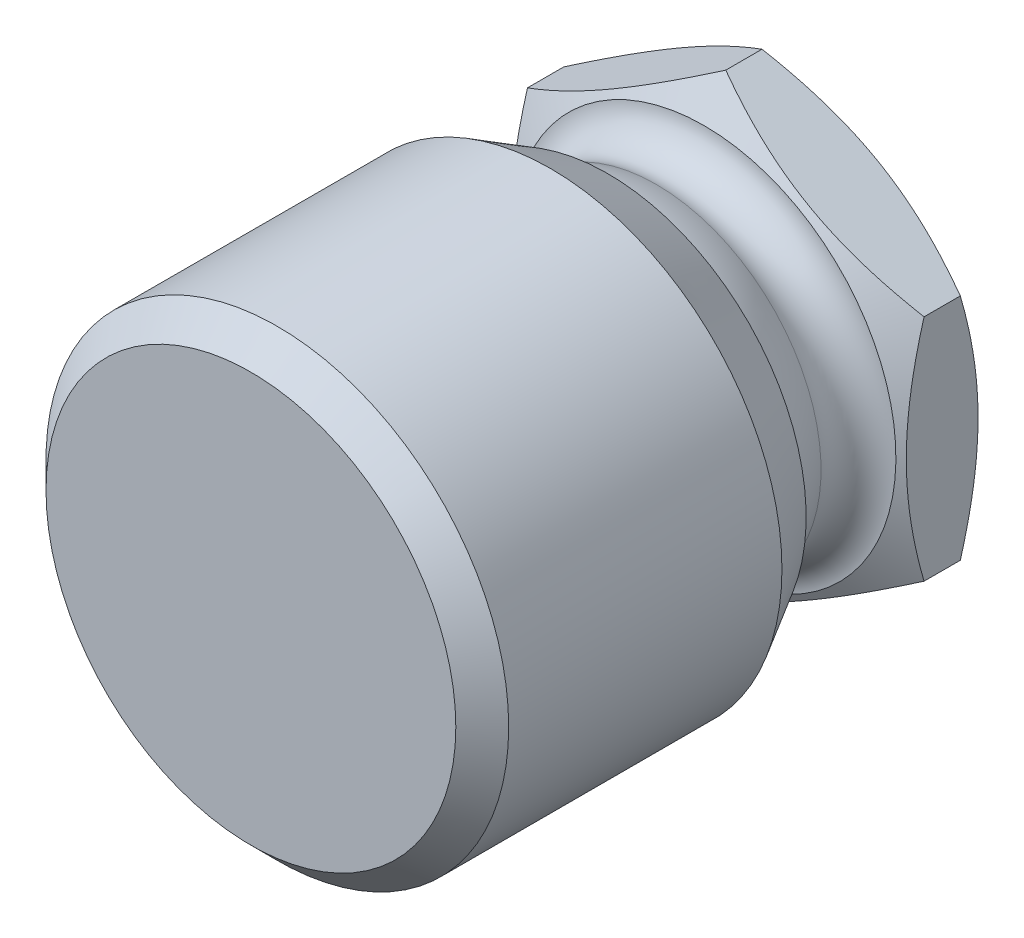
ISO-10303-21;
HEADER;
FILE_DESCRIPTION(('STEP AP214'),'2;1');
FILE_NAME('part.step','',(''),(''),'','','');
FILE_SCHEMA(('AUTOMOTIVE_DESIGN { 1 0 10303 214 1 1 1 1 }'));
ENDSEC;
DATA;
#1=APPLICATION_CONTEXT('core data for automotive mechanical design processes');
#2=APPLICATION_PROTOCOL_DEFINITION('international standard','automotive_design',2000,#1);
#3=PRODUCT_CONTEXT('',#1,'mechanical');
#4=PRODUCT('Part','Part','',(#3));
#5=PRODUCT_RELATED_PRODUCT_CATEGORY('part','',(#4));
#6=PRODUCT_DEFINITION_FORMATION('','',#4);
#7=PRODUCT_DEFINITION_CONTEXT('part definition',#1,'design');
#8=PRODUCT_DEFINITION('design','',#6,#7);
#9=PRODUCT_DEFINITION_SHAPE('','',#8);
#10=(LENGTH_UNIT() NAMED_UNIT(*) SI_UNIT(.MILLI.,.METRE.));
#11=(NAMED_UNIT(*) PLANE_ANGLE_UNIT() SI_UNIT($,.RADIAN.));
#12=(NAMED_UNIT(*) SI_UNIT($,.STERADIAN.) SOLID_ANGLE_UNIT());
#13=UNCERTAINTY_MEASURE_WITH_UNIT(LENGTH_MEASURE(1.E-05),#10,'distance_accuracy_value','');
#14=(GEOMETRIC_REPRESENTATION_CONTEXT(3) GLOBAL_UNCERTAINTY_ASSIGNED_CONTEXT((#13)) GLOBAL_UNIT_ASSIGNED_CONTEXT((#10,
#11,#12)) REPRESENTATION_CONTEXT('',''));
#15=CARTESIAN_POINT('',(0.,0.,0.));
#16=DIRECTION('',(0.,0.,1.));
#17=DIRECTION('',(1.,0.,0.));
#18=AXIS2_PLACEMENT_3D('',#15,#16,#17);
#19=CARTESIAN_POINT('',(0.,0.,13.2907042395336));
#20=DIRECTION('',(0.,0.,1.));
#21=DIRECTION('',(-1.,0.,0.));
#22=AXIS2_PLACEMENT_3D('',#19,#20,#21);
#23=CONICAL_SURFACE('',#22,15.,0.523598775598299);
#24=CARTESIAN_POINT('',(0.,0.,13.2907042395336));
#25=DIRECTION('',(0.,0.,-1.));
#26=DIRECTION('',(-1.,0.,0.));
#27=AXIS2_PLACEMENT_3D('',#24,#25,#26);
#28=CIRCLE('',#27,15.);
#29=CARTESIAN_POINT('',(-15.,0.,13.2907042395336));
#30=VERTEX_POINT('',#29);
#31=EDGE_CURVE('E242',#30,#30,#28,.T.);
#32=ORIENTED_EDGE('',*,*,#31,.F.);
#33=EDGE_LOOP('',(#32));
#34=FACE_BOUND('',#33,.T.);
#35=CARTESIAN_POINT('',(0.,0.,17.6208312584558));
#36=DIRECTION('',(0.,0.,1.));
#37=DIRECTION('',(1.,0.,0.));
#38=AXIS2_PLACEMENT_3D('',#35,#36,#37);
#39=CIRCLE('',#38,17.5);
#40=CARTESIAN_POINT('',(17.5,0.,17.6208312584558));
#41=VERTEX_POINT('',#40);
#42=EDGE_CURVE('E246',#41,#41,#39,.F.);
#43=ORIENTED_EDGE('',*,*,#42,.T.);
#44=EDGE_LOOP('',(#43));
#45=FACE_BOUND('',#44,.T.);
#46=ADVANCED_FACE('F14',(#34,#45),#23,.T.);
#47=CARTESIAN_POINT('',(0.,0.,40.2907042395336));
#48=DIRECTION('',(0.,0.,-1.));
#49=DIRECTION('',(-1.,0.,0.));
#50=AXIS2_PLACEMENT_3D('',#47,#48,#49);
#51=CONICAL_SURFACE('',#50,15.5,0.785398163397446);
#52=CARTESIAN_POINT('',(0.,0.,38.2907042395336));
#53=DIRECTION('',(0.,0.,1.));
#54=DIRECTION('',(1.,0.,0.));
#55=AXIS2_PLACEMENT_3D('',#52,#53,#54);
#56=CIRCLE('',#55,17.5);
#57=CARTESIAN_POINT('',(17.5,0.,38.2907042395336));
#58=VERTEX_POINT('',#57);
#59=EDGE_CURVE('E232',#58,#58,#56,.F.);
#60=ORIENTED_EDGE('',*,*,#59,.F.);
#61=EDGE_LOOP('',(#60));
#62=FACE_BOUND('',#61,.T.);
#63=CARTESIAN_POINT('',(0.,0.,40.2907042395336));
#64=DIRECTION('',(0.,0.,1.));
#65=DIRECTION('',(1.,0.,0.));
#66=AXIS2_PLACEMENT_3D('',#63,#64,#65);
#67=CIRCLE('',#66,15.5);
#68=CARTESIAN_POINT('',(15.5,0.,40.2907042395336));
#69=VERTEX_POINT('',#68);
#70=EDGE_CURVE('E236',#69,#69,#67,.T.);
#71=ORIENTED_EDGE('',*,*,#70,.F.);
#72=EDGE_LOOP('',(#71));
#73=FACE_BOUND('',#72,.T.);
#74=ADVANCED_FACE('F16',(#62,#73),#51,.T.);
#75=CARTESIAN_POINT('',(0.,0.,40.2907042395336));
#76=DIRECTION('',(0.,0.,1.));
#77=DIRECTION('',(1.,0.,0.));
#78=AXIS2_PLACEMENT_3D('',#75,#76,#77);
#79=PLANE('',#78);
#80=ORIENTED_EDGE('',*,*,#70,.T.);
#81=EDGE_LOOP('',(#80));
#82=FACE_BOUND('',#81,.T.);
#83=ADVANCED_FACE('F256',(#82),#79,.T.);
#84=CARTESIAN_POINT('',(0.,0.,40.2907042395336));
#85=DIRECTION('',(0.,0.,-1.));
#86=DIRECTION('',(-1.,0.,0.));
#87=AXIS2_PLACEMENT_3D('',#84,#85,#86);
#88=CYLINDRICAL_SURFACE('',#87,17.5);
#89=ORIENTED_EDGE('',*,*,#59,.T.);
#90=EDGE_LOOP('',(#89));
#91=FACE_BOUND('',#90,.T.);
#92=ORIENTED_EDGE('',*,*,#42,.F.);
#93=EDGE_LOOP('',(#92));
#94=FACE_BOUND('',#93,.T.);
#95=ADVANCED_FACE('F264',(#91,#94),#88,.T.);
#96=CARTESIAN_POINT('',(0.,0.,13.2907042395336));
#97=DIRECTION('',(0.,0.,1.));
#98=DIRECTION('',(1.,0.,0.));
#99=AXIS2_PLACEMENT_3D('',#96,#97,#98);
#100=PLANE('',#99);
#101=ORIENTED_EDGE('',*,*,#31,.T.);
#102=EDGE_LOOP('',(#101));
#103=FACE_BOUND('',#102,.T.);
#104=CARTESIAN_POINT('',(0.,0.,13.2907042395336));
#105=DIRECTION('',(0.,0.,1.));
#106=DIRECTION('',(1.,0.,0.));
#107=AXIS2_PLACEMENT_3D('',#104,#105,#106);
#108=CIRCLE('',#107,13.7353455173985);
#109=CARTESIAN_POINT('',(0.,13.7353455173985,13.2907042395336));
#110=VERTEX_POINT('',#109);
#111=EDGE_CURVE('E9',#110,#110,#108,.T.);
#112=ORIENTED_EDGE('',*,*,#111,.T.);
#113=EDGE_LOOP('',(#112));
#114=FACE_BOUND('',#113,.T.);
#115=ADVANCED_FACE('F272',(#103,#114),#100,.F.);
#116=CARTESIAN_POINT('',(0.,0.,16.));
#117=DIRECTION('',(0.,0.,-1.));
#118=DIRECTION('',(0.,1.,0.));
#119=AXIS2_PLACEMENT_3D('',#116,#117,#118);
#120=SPHERICAL_SURFACE('',#119,14.);
#121=CARTESIAN_POINT('',(0.,0.,9.63002501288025));
#122=DIRECTION('',(0.,0.,1.));
#123=DIRECTION('',(0.,1.,0.));
#124=AXIS2_PLACEMENT_3D('',#121,#122,#123);
#125=CIRCLE('',#124,12.4668929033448);
#126=CARTESIAN_POINT('',(0.,12.4668929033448,9.63002501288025));
#127=VERTEX_POINT('',#126);
#128=EDGE_CURVE('E23',#127,#127,#125,.T.);
#129=CARTESIAN_POINT('',(0.,12.4668929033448,9.63002501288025));
#130=CARTESIAN_POINT('',(0.,12.4853141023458,9.6660777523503));
#131=CARTESIAN_POINT('',(0.,12.5035789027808,9.70221040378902));
#132=CARTESIAN_POINT('',(0.,12.539794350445,9.77463280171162));
#133=CARTESIAN_POINT('',(0.,12.5577449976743,9.81092254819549));
#134=CARTESIAN_POINT('',(0.,12.5933307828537,9.88365640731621));
#135=CARTESIAN_POINT('',(0.,12.6109659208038,9.92010051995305));
#136=CARTESIAN_POINT('',(0.,12.645919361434,9.99314036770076));
#137=CARTESIAN_POINT('',(0.,12.6632376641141,10.0297361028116));
#138=CARTESIAN_POINT('',(0.,12.6975561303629,10.1030764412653));
#139=CARTESIAN_POINT('',(0.,12.7145562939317,10.1398210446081));
#140=CARTESIAN_POINT('',(0.,12.7482372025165,10.2134563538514));
#141=CARTESIAN_POINT('',(0.,12.7649179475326,10.2503470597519));
#142=CARTESIAN_POINT('',(0.,12.7979587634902,10.3242717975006));
#143=CARTESIAN_POINT('',(0.,12.8143188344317,10.3613058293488));
#144=CARTESIAN_POINT('',(0.,12.8467170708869,10.4355144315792));
#145=CARTESIAN_POINT('',(0.,12.8627552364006,10.4726890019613));
#146=CARTESIAN_POINT('',(0.,12.8945084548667,10.5471758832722));
#147=CARTESIAN_POINT('',(0.,12.9102235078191,10.584488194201));
#148=CARTESIAN_POINT('',(0.,12.9413293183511,10.6592477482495));
#149=CARTESIAN_POINT('',(0.,12.9567200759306,10.6966949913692));
#150=CARTESIAN_POINT('',(0.,12.9871761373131,10.7717215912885));
#151=CARTESIAN_POINT('',(0.,13.002241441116,10.8093009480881));
#152=CARTESIAN_POINT('',(0.,13.0320454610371,10.8845889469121));
#153=CARTESIAN_POINT('',(0.,13.0467841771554,10.9222975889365));
#154=CARTESIAN_POINT('',(0.,13.0759339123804,10.9978413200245));
#155=CARTESIAN_POINT('',(0.,13.090344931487,11.0356764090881));
#156=CARTESIAN_POINT('',(0.,13.1188381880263,11.1114701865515));
#157=CARTESIAN_POINT('',(0.,13.1329204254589,11.1494288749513));
#158=CARTESIAN_POINT('',(0.,13.1607550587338,11.2254669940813));
#159=CARTESIAN_POINT('',(0.,13.174507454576,11.2635464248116));
#160=CARTESIAN_POINT('',(0.,13.2016813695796,11.339823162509));
#161=CARTESIAN_POINT('',(0.,13.215102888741,11.3780204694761));
#162=CARTESIAN_POINT('',(0.,13.2416140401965,11.4545300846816));
#163=CARTESIAN_POINT('',(0.,13.2547036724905,11.4928423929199));
#164=CARTESIAN_POINT('',(0.,13.2805500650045,11.5695791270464));
#165=CARTESIAN_POINT('',(0.,13.2933068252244,11.6080035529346));
#166=CARTESIAN_POINT('',(0.,13.3184865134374,11.6849616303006));
#167=CARTESIAN_POINT('',(0.,13.3309094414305,11.7234952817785));
#168=CARTESIAN_POINT('',(0.,13.3554205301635,11.800668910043));
#169=CARTESIAN_POINT('',(0.,13.3675086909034,11.8393088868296));
#170=CARTESIAN_POINT('',(0.,13.3913493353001,11.9166922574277));
#171=CARTESIAN_POINT('',(0.,13.4031018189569,11.9554356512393));
#172=CARTESIAN_POINT('',(0.,13.426270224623,12.0330229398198));
#173=CARTESIAN_POINT('',(0.,13.4376861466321,12.0718668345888));
#174=CARTESIAN_POINT('',(0.,13.4601805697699,12.1496522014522));
#175=CARTESIAN_POINT('',(0.,13.4712590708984,12.1885936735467));
#176=CARTESIAN_POINT('',(0.,13.4930778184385,12.266571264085));
#177=CARTESIAN_POINT('',(0.,13.5038180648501,12.3056073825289));
#178=CARTESIAN_POINT('',(0.,13.5249594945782,12.3837713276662));
#179=CARTESIAN_POINT('',(0.,13.5353606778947,12.4228991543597));
#180=CARTESIAN_POINT('',(0.,13.5558231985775,12.5012435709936));
#181=CARTESIAN_POINT('',(0.,13.5658845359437,12.5404601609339));
#182=CARTESIAN_POINT('',(0.,13.5856666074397,12.6189791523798));
#183=CARTESIAN_POINT('',(0.,13.5953873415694,12.6582815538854));
#184=CARTESIAN_POINT('',(0.,13.6144874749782,12.736969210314));
#185=CARTESIAN_POINT('',(0.,13.6238668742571,12.776354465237));
#186=CARTESIAN_POINT('',(0.,13.6422836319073,12.8552048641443));
#187=CARTESIAN_POINT('',(0.,13.6513209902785,12.8946700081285));
#188=CARTESIAN_POINT('',(0.,13.6690529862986,12.9736772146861));
#189=CARTESIAN_POINT('',(0.,13.6777476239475,13.0132192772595));
#190=CARTESIAN_POINT('',(0.,13.6947935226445,13.0923773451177));
#191=CARTESIAN_POINT('',(0.,13.7031447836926,13.1319933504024));
#192=CARTESIAN_POINT('',(0.,13.7195033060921,13.2112963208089));
#193=CARTESIAN_POINT('',(0.,13.7275105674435,13.2509832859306));
#194=CARTESIAN_POINT('',(0.,13.7353455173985,13.2907042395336));
#195=B_SPLINE_CURVE_WITH_KNOTS('',3,(#129,#130,#131,#132,#133,#134,#135,#136,#137,#138,#139,
#140,#141,#142,#143,#144,#145,#146,#147,#148,#149,#150,#151,#152,#153,#154,#155,#156,#157,#158,
#159,#160,#161,#162,#163,#164,#165,#166,#167,#168,#169,#170,#171,#172,#173,#174,#175,#176,#177,
#178,#179,#180,#181,#182,#183,#184,#185,#186,#187,#188,#189,#190,#191,#192,#193,#194),
.UNSPECIFIED.,.F.,.F.,(4,2,2,2,2,2,2,2,2,2,2,2,2,2,2,2,2,2,2,2,2,2,2,2,2,2,2,2,2,2,2,2,4),(0.,
0.121458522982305,0.242917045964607,0.364375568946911,0.485834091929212,0.607292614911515,
0.728751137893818,0.85020966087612,0.971668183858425,1.09312670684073,1.21458522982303,
1.33604375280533,1.45750227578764,1.57896079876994,1.70041932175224,1.82187784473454,
1.94333636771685,2.06479489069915,2.18625341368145,2.30771193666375,2.42917045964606,
2.55062898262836,2.67208750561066,2.79354602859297,2.91500455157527,3.03646307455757,
3.15792159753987,3.27938012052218,3.40083864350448,3.52229716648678,3.64375568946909,
3.76521421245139,3.88667273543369),.UNSPECIFIED.);
#196=EDGE_CURVE('BSEAM135',#127,#110,#195,.T.);
#197=ORIENTED_EDGE('',*,*,#128,.T.);
#198=ORIENTED_EDGE('',*,*,#111,.F.);
#199=ORIENTED_EDGE('',*,*,#196,.T.);
#200=ORIENTED_EDGE('',*,*,#196,.F.);
#201=EDGE_LOOP('',(#197,#199,#198,#200));
#202=FACE_BOUND('',#201,.T.);
#203=ADVANCED_FACE('F135',(#202),#120,.T.);
#204=CARTESIAN_POINT('',(0.,0.,8.492529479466));
#205=DIRECTION('',(0.,0.,1.));
#206=DIRECTION('',(0.,1.,0.));
#207=AXIS2_PLACEMENT_3D('',#204,#205,#206);
#208=TOROIDAL_SURFACE('',#207,14.6931237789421,2.5);
#209=ORIENTED_EDGE('',*,*,#128,.F.);
#210=EDGE_LOOP('',(#209));
#211=FACE_BOUND('',#210,.T.);
#212=CARTESIAN_POINT('',(0.,0.,6.));
#213=DIRECTION('',(0.,0.,1.));
#214=DIRECTION('',(0.,1.,0.));
#215=AXIS2_PLACEMENT_3D('',#212,#213,#214);
#216=CIRCLE('',#215,14.5);
#217=CARTESIAN_POINT('',(0.,14.5,6.));
#218=VERTEX_POINT('',#217);
#219=EDGE_CURVE('E84',#218,#218,#216,.T.);
#220=ORIENTED_EDGE('',*,*,#219,.T.);
#221=EDGE_LOOP('',(#220));
#222=FACE_BOUND('',#221,.T.);
#223=ADVANCED_FACE('F131',(#211,#222),#208,.F.);
#224=CARTESIAN_POINT('',(0.,0.,6.));
#225=DIRECTION('',(0.,0.,-1.));
#226=DIRECTION('',(0.,1.,0.));
#227=AXIS2_PLACEMENT_3D('',#224,#225,#226);
#228=CONICAL_SURFACE('',#227,14.5,1.0471975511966);
#229=ORIENTED_EDGE('',*,*,#219,.F.);
#230=EDGE_LOOP('',(#229));
#231=FACE_BOUND('',#230,.T.);
#232=CARTESIAN_POINT('',(15.0002,8.66013856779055,4.37151223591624));
#233=CARTESIAN_POINT('',(14.6705058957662,8.85048754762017,4.48140307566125));
#234=CARTESIAN_POINT('',(14.3395258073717,9.04157899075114,4.58630727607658));
#235=CARTESIAN_POINT('',(13.674911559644,9.425294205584,4.78475628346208));
#236=CARTESIAN_POINT('',(13.3412765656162,9.61791845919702,4.87829735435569));
#237=CARTESIAN_POINT('',(12.6707077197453,10.0050715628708,5.05276271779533));
#238=CARTESIAN_POINT('',(12.333767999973,10.199603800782,5.133657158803));
#239=CARTESIAN_POINT('',(11.6575472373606,10.5900200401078,5.28109222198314));
#240=CARTESIAN_POINT('',(11.3182663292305,10.7859039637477,5.34763366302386));
#241=CARTESIAN_POINT('',(10.6460568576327,11.1740042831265,5.46353249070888));
#242=CARTESIAN_POINT('',(10.3131781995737,11.3661918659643,5.51327348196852));
#243=CARTESIAN_POINT('',(9.6458955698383,11.7514476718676,5.59667811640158));
#244=CARTESIAN_POINT('',(9.31149156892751,11.9445159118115,5.6303414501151));
#245=CARTESIAN_POINT('',(8.64212181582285,12.3309767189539,5.6807407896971));
#246=CARTESIAN_POINT('',(8.30715720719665,12.5243686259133,5.69749691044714));
#247=CARTESIAN_POINT('',(7.63691878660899,12.9113309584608,5.71372147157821));
#248=CARTESIAN_POINT('',(7.30164498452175,13.1049013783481,5.71319044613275));
#249=CARTESIAN_POINT('',(6.67485311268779,13.4667798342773,5.69604825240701));
#250=CARTESIAN_POINT('',(6.38329037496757,13.6351136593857,5.68152801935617));
#251=CARTESIAN_POINT('',(5.80083556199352,13.9713941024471,5.63968772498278));
#252=CARTESIAN_POINT('',(5.50994353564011,14.1393406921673,5.61236675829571));
#253=CARTESIAN_POINT('',(4.92898814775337,14.4747554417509,5.54540135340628));
#254=CARTESIAN_POINT('',(4.63892567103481,14.6422230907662,5.50574673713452));
#255=CARTESIAN_POINT('',(4.06016058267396,14.9763732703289,5.41480976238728));
#256=CARTESIAN_POINT('',(3.77145806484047,15.1430557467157,5.36352661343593));
#257=CARTESIAN_POINT('',(2.89508556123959,15.6490296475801,5.19093800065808));
#258=CARTESIAN_POINT('',(2.30995340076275,15.9868558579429,5.05242368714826));
#259=CARTESIAN_POINT('',(1.14841408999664,16.657470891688,4.73805289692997));
#260=CARTESIAN_POINT('',(0.571992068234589,16.9902683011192,4.56227025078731));
#261=CARTESIAN_POINT('',(-0.000199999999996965,17.3206235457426,4.37151223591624));
#262=B_SPLINE_CURVE_WITH_KNOTS('',3,(#232,#233,#234,#235,#236,#237,#238,#239,#240,#241,#242,
#243,#244,#245,#246,#247,#248,#249,#250,#251,#252,#253,#254,#255,#256,#257,#258,#259,#260,#261),
.UNSPECIFIED.,.F.,.F.,(4,2,2,2,2,2,2,2,2,2,2,2,2,2,4),(0.,1.18875411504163,2.37789802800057,
3.56980778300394,4.76164951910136,5.92407379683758,7.08652044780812,8.24758247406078,
9.40860862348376,10.4193068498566,11.4300765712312,12.4416826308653,13.4533574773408,
15.5211962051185,17.5849760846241),.UNSPECIFIED.);
#263=CARTESIAN_POINT('',(15.,8.66025403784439,4.37157890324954));
#264=VERTEX_POINT('',#263);
#265=CARTESIAN_POINT('',(0.,17.3205080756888,4.37157890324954));
#266=VERTEX_POINT('',#265);
#267=EDGE_CURVE('E89',#264,#266,#262,.T.);
#268=ORIENTED_EDGE('',*,*,#267,.T.);
#269=CARTESIAN_POINT('',(0.000200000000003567,17.3206235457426,4.37151223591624));
#270=CARTESIAN_POINT('',(-0.329494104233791,17.130274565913,4.48140307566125));
#271=CARTESIAN_POINT('',(-0.66047419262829,16.939183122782,4.58630727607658));
#272=CARTESIAN_POINT('',(-1.32508844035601,16.5554679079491,4.78475628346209));
#273=CARTESIAN_POINT('',(-1.65872343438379,16.3628436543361,4.8782973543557));
#274=CARTESIAN_POINT('',(-2.32929228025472,15.9756905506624,5.05276271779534));
#275=CARTESIAN_POINT('',(-2.666232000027,15.7811583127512,5.13365715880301));
#276=CARTESIAN_POINT('',(-3.34245276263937,15.3907420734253,5.28109222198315));
#277=CARTESIAN_POINT('',(-3.6817336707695,15.1948581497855,5.34763366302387));
#278=CARTESIAN_POINT('',(-4.3539431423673,14.8067578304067,5.46353249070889));
#279=CARTESIAN_POINT('',(-4.68682180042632,14.6145702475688,5.51327348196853));
#280=CARTESIAN_POINT('',(-5.35410443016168,14.2293144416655,5.59667811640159));
#281=CARTESIAN_POINT('',(-5.68850843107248,14.0362462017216,5.63034145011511));
#282=CARTESIAN_POINT('',(-6.35787818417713,13.6497853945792,5.68074078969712));
#283=CARTESIAN_POINT('',(-6.69284279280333,13.4563934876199,5.69749691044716));
#284=CARTESIAN_POINT('',(-7.36308121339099,13.0694311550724,5.71372147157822));
#285=CARTESIAN_POINT('',(-7.69835501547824,12.8758607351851,5.71319044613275));
#286=CARTESIAN_POINT('',(-8.32514688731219,12.5139822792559,5.69604825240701));
#287=CARTESIAN_POINT('',(-8.61670962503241,12.3456484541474,5.68152801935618));
#288=CARTESIAN_POINT('',(-9.19916443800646,12.0093680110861,5.6396877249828));
#289=CARTESIAN_POINT('',(-9.49005646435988,11.8414214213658,5.61236675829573));
#290=CARTESIAN_POINT('',(-10.0710118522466,11.5060066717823,5.54540135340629));
#291=CARTESIAN_POINT('',(-10.3610743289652,11.338539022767,5.50574673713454));
#292=CARTESIAN_POINT('',(-10.939839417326,11.0043888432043,5.4148097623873));
#293=CARTESIAN_POINT('',(-11.2285419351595,10.8377063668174,5.36352661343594));
#294=CARTESIAN_POINT('',(-12.1049144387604,10.331732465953,5.19093800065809));
#295=CARTESIAN_POINT('',(-12.6900465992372,9.99390625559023,5.05242368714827));
#296=CARTESIAN_POINT('',(-13.8515859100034,9.32329122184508,4.73805289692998));
#297=CARTESIAN_POINT('',(-14.4280079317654,8.99049381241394,4.56227025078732));
#298=CARTESIAN_POINT('',(-15.0002,8.66013856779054,4.37151223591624));
#299=B_SPLINE_CURVE_WITH_KNOTS('',3,(#269,#270,#271,#272,#273,#274,#275,#276,#277,#278,#279,
#280,#281,#282,#283,#284,#285,#286,#287,#288,#289,#290,#291,#292,#293,#294,#295,#296,#297,#298),
.UNSPECIFIED.,.F.,.F.,(4,2,2,2,2,2,2,2,2,2,2,2,2,2,4),(0.,1.18875411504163,2.37789802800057,
3.56980778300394,4.76164951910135,5.92407379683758,7.08652044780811,8.24758247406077,
9.40860862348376,10.4193068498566,11.4300765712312,12.4416826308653,13.4533574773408,
15.5211962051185,17.5849760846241),.UNSPECIFIED.);
#300=CARTESIAN_POINT('',(-15.,8.66025403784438,4.37157890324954));
#301=VERTEX_POINT('',#300);
#302=EDGE_CURVE('E93',#266,#301,#299,.T.);
#303=ORIENTED_EDGE('',*,*,#302,.T.);
#304=CARTESIAN_POINT('',(-15.,-23.5394233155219,-1.7436773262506));
#305=CARTESIAN_POINT('',(-15.,-23.2106725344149,-1.58361255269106));
#306=CARTESIAN_POINT('',(-15.,-22.8815433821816,-1.42432526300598));
#307=CARTESIAN_POINT('',(-15.,-22.222449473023,-1.10748120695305));
#308=CARTESIAN_POINT('',(-15.,-21.8924847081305,-0.949924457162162));
#309=CARTESIAN_POINT('',(-15.,-20.9011345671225,-0.480073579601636));
#310=CARTESIAN_POINT('',(-15.,-20.238386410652,-0.170644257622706));
#311=CARTESIAN_POINT('',(-15.,-18.9050706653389,0.440362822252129));
#312=CARTESIAN_POINT('',(-15.,-18.2344803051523,0.741891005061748));
#313=CARTESIAN_POINT('',(-15.,-16.888062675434,1.33297710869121));
#314=CARTESIAN_POINT('',(-15.,-16.2122356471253,1.62253557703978));
#315=CARTESIAN_POINT('',(-15.,-14.8314209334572,2.19601357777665));
#316=CARTESIAN_POINT('',(-15.,-14.1262172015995,2.47941555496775));
#317=CARTESIAN_POINT('',(-15.,-12.7076573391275,3.02543463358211));
#318=CARTESIAN_POINT('',(-15.,-11.9943003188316,3.28804944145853));
#319=CARTESIAN_POINT('',(-15.,-10.5595695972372,3.78579790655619));
#320=CARTESIAN_POINT('',(-15.,-9.83821454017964,4.02098488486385));
#321=CARTESIAN_POINT('',(-15.,-8.38509302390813,4.45652926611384));
#322=CARTESIAN_POINT('',(-15.,-7.6533298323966,4.65689735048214));
#323=CARTESIAN_POINT('',(-15.,-6.54976630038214,4.92367215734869));
#324=CARTESIAN_POINT('',(-15.,-6.18198027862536,5.00677856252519));
#325=CARTESIAN_POINT('',(-15.,-5.44384520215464,5.16076962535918));
#326=CARTESIAN_POINT('',(-15.,-5.07349619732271,5.2316545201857));
#327=CARTESIAN_POINT('',(-15.,-4.3304699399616,5.35996910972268));
#328=CARTESIAN_POINT('',(-15.,-3.95779273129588,5.41739905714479));
#329=CARTESIAN_POINT('',(-15.,-3.21048393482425,5.51766891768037));
#330=CARTESIAN_POINT('',(-15.,-2.83585243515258,5.56050948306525));
#331=CARTESIAN_POINT('',(-15.,-2.09016828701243,5.63019688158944));
#332=CARTESIAN_POINT('',(-15.,-1.71913510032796,5.65725068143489));
#333=CARTESIAN_POINT('',(-15.,-0.976256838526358,5.69563074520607));
#334=CARTESIAN_POINT('',(-15.,-0.604411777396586,5.70695727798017));
#335=CARTESIAN_POINT('',(-15.,0.13942481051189,5.71361206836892));
#336=CARTESIAN_POINT('',(-15.,0.511416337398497,5.70894031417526));
#337=CARTESIAN_POINT('',(-15.,1.2548651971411,5.68371557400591));
#338=CARTESIAN_POINT('',(-15.,1.62632250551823,5.6631618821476));
#339=CARTESIAN_POINT('',(-15.,2.51076437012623,5.59575893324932));
#340=CARTESIAN_POINT('',(-15.,3.0232198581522,5.5418355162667));
#341=CARTESIAN_POINT('',(-15.,4.04451129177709,5.40663372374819));
#342=CARTESIAN_POINT('',(-15.,4.55334676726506,5.32535185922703));
#343=CARTESIAN_POINT('',(-15.,5.56684892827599,5.13832418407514));
#344=CARTESIAN_POINT('',(-15.,6.07151223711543,5.03256024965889));
#345=CARTESIAN_POINT('',(-15.,7.07586820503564,4.7998104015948));
#346=CARTESIAN_POINT('',(-15.,7.57556092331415,4.67282474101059));
#347=CARTESIAN_POINT('',(-15.,8.58123059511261,4.39766326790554));
#348=CARTESIAN_POINT('',(-15.,9.08709315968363,4.24907229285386));
#349=CARTESIAN_POINT('',(-15.,10.0938393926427,3.93597135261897));
#350=CARTESIAN_POINT('',(-15.,10.5947230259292,3.7714612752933));
#351=CARTESIAN_POINT('',(-15.,11.5917504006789,3.42918349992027));
#352=CARTESIAN_POINT('',(-15.,12.0878955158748,3.251419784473));
#353=CARTESIAN_POINT('',(-15.,13.0760359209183,2.88478153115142));
#354=CARTESIAN_POINT('',(-15.,13.5680312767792,2.69590717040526));
#355=CARTESIAN_POINT('',(-15.,14.79276450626,2.21238428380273));
#356=CARTESIAN_POINT('',(-15.,15.5232172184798,1.91195406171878));
#357=CARTESIAN_POINT('',(-15.,16.9773370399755,1.29504619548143));
#358=CARTESIAN_POINT('',(-15.,17.7010035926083,0.978567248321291));
#359=CARTESIAN_POINT('',(-15.,19.142928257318,0.333007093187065));
#360=CARTESIAN_POINT('',(-15.,19.8611847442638,0.00392226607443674));
#361=CARTESIAN_POINT('',(-15.,21.2930546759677,-0.664117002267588));
#362=CARTESIAN_POINT('',(-15.,22.0066682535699,-1.00307115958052));
#363=CARTESIAN_POINT('',(-15.,23.4310196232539,-1.68933199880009));
#364=CARTESIAN_POINT('',(-15.,24.1417523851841,-2.03664910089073));
#365=CARTESIAN_POINT('',(-15.,25.5600483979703,-2.73769598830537));
#366=CARTESIAN_POINT('',(-15.,26.2676116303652,-3.09142581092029));
#367=CARTESIAN_POINT('',(-15.,27.6799721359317,-3.80407420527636));
#368=CARTESIAN_POINT('',(-15.,28.3847698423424,-4.16299191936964));
#369=CARTESIAN_POINT('',(-15.,29.7921315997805,-4.88517141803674));
#370=CARTESIAN_POINT('',(-15.,30.4946956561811,-5.24843319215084));
#371=CARTESIAN_POINT('',(-15.,32.4694194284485,-6.27592054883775));
#372=CARTESIAN_POINT('',(-15.,33.7394237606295,-6.94428812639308));
#373=CARTESIAN_POINT('',(-15.,36.2748342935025,-8.28980701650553));
#374=CARTESIAN_POINT('',(-15.,37.5402402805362,-8.96695873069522));
#375=CARTESIAN_POINT('',(-15.,40.0638041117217,-10.3259383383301));
#376=CARTESIAN_POINT('',(-15.,41.3219723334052,-11.0077469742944));
#377=CARTESIAN_POINT('',(-15.,43.2070864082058,-12.0342851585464));
#378=CARTESIAN_POINT('',(-15.,43.8350813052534,-12.3770910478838));
#379=CARTESIAN_POINT('',(-15.,45.0904436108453,-13.0638477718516));
#380=CARTESIAN_POINT('',(-15.,45.7178110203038,-13.4077986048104));
#381=CARTESIAN_POINT('',(-15.,46.3449014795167,-13.7522537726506));
#382=B_SPLINE_CURVE_WITH_KNOTS('',3,(#304,#305,#306,#307,#308,#309,#310,#311,#312,#313,#314,
#315,#316,#317,#318,#319,#320,#321,#322,#323,#324,#325,#326,#327,#328,#329,#330,#331,#332,#333,
#334,#335,#336,#337,#338,#339,#340,#341,#342,#343,#344,#345,#346,#347,#348,#349,#350,#351,#352,
#353,#354,#355,#356,#357,#358,#359,#360,#361,#362,#363,#364,#365,#366,#367,#368,#369,#370,#371,
#372,#373,#374,#375,#376,#377,#378,#379,#380,#381),.UNSPECIFIED.,.F.,.F.,(4,2,2,2,2,2,2,2,2,2,2,
2,2,2,2,2,2,2,2,2,2,2,2,2,2,2,2,2,2,2,2,2,2,2,2,2,2,2,4),(0.,1.09693942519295,2.19388934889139,
4.38809987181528,6.59379553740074,8.79939019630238,11.0791970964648,13.3592551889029,
15.6348041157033,17.9096537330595,19.040659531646,20.1716433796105,21.3026059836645,
22.4335180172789,23.5492496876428,24.6649622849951,25.7806757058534,26.8964387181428,
28.4414443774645,29.9866471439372,31.5329974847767,33.0793293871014,34.660720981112,
36.2421237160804,37.8230531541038,39.403957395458,41.7731534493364,44.1425421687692,
46.5126163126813,48.8826223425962,51.2557521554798,53.6288957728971,56.001651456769,
58.3744014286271,62.6797680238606,66.9853321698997,71.2784093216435,73.42481037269,
75.5712082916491),.UNSPECIFIED.);
#383=CARTESIAN_POINT('',(-15.,-8.66025403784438,4.37157890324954));
#384=VERTEX_POINT('',#383);
#385=EDGE_CURVE('E155',#301,#384,#382,.F.);
#386=ORIENTED_EDGE('',*,*,#385,.T.);
#387=CARTESIAN_POINT('',(-15.0002,-8.66013856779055,4.37151223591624));
#388=CARTESIAN_POINT('',(-14.6705058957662,-8.85048754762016,4.48140307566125));
#389=CARTESIAN_POINT('',(-14.3395258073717,-9.04157899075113,4.58630727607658));
#390=CARTESIAN_POINT('',(-13.674911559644,-9.42529420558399,4.78475628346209));
#391=CARTESIAN_POINT('',(-13.3412765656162,-9.61791845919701,4.8782973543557));
#392=CARTESIAN_POINT('',(-12.6707077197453,-10.0050715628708,5.05276271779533));
#393=CARTESIAN_POINT('',(-12.333767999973,-10.199603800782,5.133657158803));
#394=CARTESIAN_POINT('',(-11.6575472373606,-10.5900200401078,5.28109222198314));
#395=CARTESIAN_POINT('',(-11.3182663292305,-10.7859039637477,5.34763366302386));
#396=CARTESIAN_POINT('',(-10.6460568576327,-11.1740042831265,5.46353249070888));
#397=CARTESIAN_POINT('',(-10.3131781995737,-11.3661918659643,5.51327348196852));
#398=CARTESIAN_POINT('',(-9.64589556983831,-11.7514476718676,5.59667811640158));
#399=CARTESIAN_POINT('',(-9.31149156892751,-11.9445159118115,5.6303414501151));
#400=CARTESIAN_POINT('',(-8.64212181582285,-12.3309767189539,5.68074078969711));
#401=CARTESIAN_POINT('',(-8.30715720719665,-12.5243686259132,5.69749691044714));
#402=CARTESIAN_POINT('',(-7.636918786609,-12.9113309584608,5.71372147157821));
#403=CARTESIAN_POINT('',(-7.30164498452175,-13.104901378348,5.71319044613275));
#404=CARTESIAN_POINT('',(-6.67485311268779,-13.4667798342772,5.69604825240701));
#405=CARTESIAN_POINT('',(-6.38329037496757,-13.6351136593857,5.68152801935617));
#406=CARTESIAN_POINT('',(-5.80083556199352,-13.9713941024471,5.63968772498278));
#407=CARTESIAN_POINT('',(-5.50994353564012,-14.1393406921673,5.61236675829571));
#408=CARTESIAN_POINT('',(-4.92898814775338,-14.4747554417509,5.54540135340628));
#409=CARTESIAN_POINT('',(-4.63892567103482,-14.6422230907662,5.50574673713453));
#410=CARTESIAN_POINT('',(-4.06016058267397,-14.9763732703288,5.41480976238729));
#411=CARTESIAN_POINT('',(-3.77145806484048,-15.1430557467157,5.36352661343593));
#412=CARTESIAN_POINT('',(-2.8950855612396,-15.6490296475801,5.19093800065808));
#413=CARTESIAN_POINT('',(-2.30995340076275,-15.9868558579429,5.05242368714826));
#414=CARTESIAN_POINT('',(-1.14841408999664,-16.657470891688,4.73805289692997));
#415=CARTESIAN_POINT('',(-0.571992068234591,-16.9902683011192,4.56227025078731));
#416=CARTESIAN_POINT('',(0.000199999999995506,-17.3206235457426,4.37151223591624));
#417=B_SPLINE_CURVE_WITH_KNOTS('',3,(#387,#388,#389,#390,#391,#392,#393,#394,#395,#396,#397,
#398,#399,#400,#401,#402,#403,#404,#405,#406,#407,#408,#409,#410,#411,#412,#413,#414,#415,#416),
.UNSPECIFIED.,.F.,.F.,(4,2,2,2,2,2,2,2,2,2,2,2,2,2,4),(0.,1.18875411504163,2.37789802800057,
3.56980778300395,4.76164951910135,5.92407379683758,7.08652044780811,8.24758247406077,
9.40860862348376,10.4193068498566,11.4300765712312,12.4416826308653,13.4533574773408,
15.5211962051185,17.5849760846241),.UNSPECIFIED.);
#418=CARTESIAN_POINT('',(0.,-17.3205080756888,4.37157890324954));
#419=VERTEX_POINT('',#418);
#420=EDGE_CURVE('E148',#384,#419,#417,.T.);
#421=ORIENTED_EDGE('',*,*,#420,.T.);
#422=CARTESIAN_POINT('',(-0.000200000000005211,-17.3206235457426,4.37151223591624));
#423=CARTESIAN_POINT('',(0.32949410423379,-17.130274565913,4.48140307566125));
#424=CARTESIAN_POINT('',(0.660474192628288,-16.939183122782,4.58630727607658));
#425=CARTESIAN_POINT('',(1.325088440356,-16.5554679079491,4.78475628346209));
#426=CARTESIAN_POINT('',(1.65872343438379,-16.3628436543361,4.8782973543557));
#427=CARTESIAN_POINT('',(2.32929228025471,-15.9756905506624,5.05276271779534));
#428=CARTESIAN_POINT('',(2.666232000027,-15.7811583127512,5.13365715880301));
#429=CARTESIAN_POINT('',(3.34245276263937,-15.3907420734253,5.28109222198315));
#430=CARTESIAN_POINT('',(3.6817336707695,-15.1948581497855,5.34763366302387));
#431=CARTESIAN_POINT('',(4.3539431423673,-14.8067578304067,5.46353249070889));
#432=CARTESIAN_POINT('',(4.68682180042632,-14.6145702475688,5.51327348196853));
#433=CARTESIAN_POINT('',(5.35410443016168,-14.2293144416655,5.59667811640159));
#434=CARTESIAN_POINT('',(5.68850843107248,-14.0362462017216,5.63034145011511));
#435=CARTESIAN_POINT('',(6.35787818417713,-13.6497853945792,5.68074078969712));
#436=CARTESIAN_POINT('',(6.69284279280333,-13.4563934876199,5.69749691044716));
#437=CARTESIAN_POINT('',(7.36308121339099,-13.0694311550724,5.71372147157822));
#438=CARTESIAN_POINT('',(7.69835501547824,-12.8758607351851,5.71319044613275));
#439=CARTESIAN_POINT('',(8.3251468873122,-12.5139822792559,5.69604825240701));
#440=CARTESIAN_POINT('',(8.61670962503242,-12.3456484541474,5.68152801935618));
#441=CARTESIAN_POINT('',(9.19916443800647,-12.0093680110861,5.6396877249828));
#442=CARTESIAN_POINT('',(9.49005646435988,-11.8414214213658,5.61236675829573));
#443=CARTESIAN_POINT('',(10.0710118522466,-11.5060066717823,5.54540135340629));
#444=CARTESIAN_POINT('',(10.3610743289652,-11.338539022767,5.50574673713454));
#445=CARTESIAN_POINT('',(10.939839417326,-11.0043888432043,5.4148097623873));
#446=CARTESIAN_POINT('',(11.2285419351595,-10.8377063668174,5.36352661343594));
#447=CARTESIAN_POINT('',(12.1049144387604,-10.331732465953,5.19093800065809));
#448=CARTESIAN_POINT('',(12.6900465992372,-9.99390625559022,5.05242368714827));
#449=CARTESIAN_POINT('',(13.8515859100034,-9.32329122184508,4.73805289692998));
#450=CARTESIAN_POINT('',(14.4280079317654,-8.99049381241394,4.56227025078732));
#451=CARTESIAN_POINT('',(15.0002,-8.66013856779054,4.37151223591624));
#452=B_SPLINE_CURVE_WITH_KNOTS('',3,(#422,#423,#424,#425,#426,#427,#428,#429,#430,#431,#432,
#433,#434,#435,#436,#437,#438,#439,#440,#441,#442,#443,#444,#445,#446,#447,#448,#449,#450,#451),
.UNSPECIFIED.,.F.,.F.,(4,2,2,2,2,2,2,2,2,2,2,2,2,2,4),(0.,1.18875411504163,2.37789802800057,
3.56980778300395,4.76164951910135,5.92407379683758,7.08652044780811,8.24758247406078,
9.40860862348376,10.4193068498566,11.4300765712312,12.4416826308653,13.4533574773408,
15.5211962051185,17.5849760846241),.UNSPECIFIED.);
#453=CARTESIAN_POINT('',(15.,-8.66025403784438,4.37157890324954));
#454=VERTEX_POINT('',#453);
#455=EDGE_CURVE('E39',#419,#454,#452,.T.);
#456=ORIENTED_EDGE('',*,*,#455,.T.);
#457=CARTESIAN_POINT('',(15.,-23.5394233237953,-1.74367733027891));
#458=CARTESIAN_POINT('',(15.,-23.2106725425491,-1.58361255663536));
#459=CARTESIAN_POINT('',(15.,-22.8815433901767,-1.42432526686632));
#460=CARTESIAN_POINT('',(15.,-22.2224494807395,-1.10748121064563));
#461=CARTESIAN_POINT('',(15.,-21.8924847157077,-0.949924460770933));
#462=CARTESIAN_POINT('',(15.,-20.9011345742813,-0.480073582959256));
#463=CARTESIAN_POINT('',(15.,-20.2383864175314,-0.170644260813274));
#464=CARTESIAN_POINT('',(15.,-18.9050706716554,0.440362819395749));
#465=CARTESIAN_POINT('',(15.,-18.2344803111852,0.741891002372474));
#466=CARTESIAN_POINT('',(15.,-16.8880626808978,1.33297710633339));
#467=CARTESIAN_POINT('',(15.,-16.2122356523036,1.62253557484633));
#468=CARTESIAN_POINT('',(15.,-14.8314209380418,2.19601357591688));
#469=CARTESIAN_POINT('',(15.,-14.1262172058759,2.47941555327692));
#470=CARTESIAN_POINT('',(15.,-12.7076573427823,3.02543463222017));
#471=CARTESIAN_POINT('',(15.,-11.9943003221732,3.28804944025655));
#472=CARTESIAN_POINT('',(15.,-10.5595695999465,3.78579790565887));
#473=CARTESIAN_POINT('',(15.,-9.83821454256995,4.0209848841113));
#474=CARTESIAN_POINT('',(15.,-8.38509302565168,4.45652926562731));
#475=CARTESIAN_POINT('',(15.,-7.65332983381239,4.6568973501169));
#476=CARTESIAN_POINT('',(15.,-6.54976630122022,4.92367215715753));
#477=CARTESIAN_POINT('',(15.,-6.1819802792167,5.00677856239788));
#478=CARTESIAN_POINT('',(15.,-5.44384520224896,5.16076962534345));
#479=CARTESIAN_POINT('',(15.,-5.07349619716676,5.2316545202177));
#480=CARTESIAN_POINT('',(15.,-4.33046993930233,5.35996910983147));
#481=CARTESIAN_POINT('',(15.,-3.95779273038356,5.41739905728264));
#482=CARTESIAN_POINT('',(15.,-3.21048393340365,5.51766891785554));
#483=CARTESIAN_POINT('',(15.,-2.83585243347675,5.56050948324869));
#484=CARTESIAN_POINT('',(15.,-2.09016828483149,5.63019688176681));
#485=CARTESIAN_POINT('',(15.,-1.71913509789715,5.65725068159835));
#486=CARTESIAN_POINT('',(15.,-0.976256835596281,5.69563074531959));
#487=CARTESIAN_POINT('',(15.,-0.604411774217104,5.70695727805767));
#488=CARTESIAN_POINT('',(15.,0.13942481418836,5.71361206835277));
#489=CARTESIAN_POINT('',(15.,0.511416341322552,5.70894031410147));
#490=CARTESIAN_POINT('',(15.,1.25486520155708,5.68371557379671));
#491=CARTESIAN_POINT('',(15.,1.62632251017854,5.66316188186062));
#492=CARTESIAN_POINT('',(15.,2.51076437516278,5.59575893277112));
#493=CARTESIAN_POINT('',(15.,3.02321986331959,5.54183551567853));
#494=CARTESIAN_POINT('',(15.,4.04451129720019,5.40663372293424));
#495=CARTESIAN_POINT('',(15.,4.55334677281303,5.32535185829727));
#496=CARTESIAN_POINT('',(15.,5.56684893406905,5.13832418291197));
#497=CARTESIAN_POINT('',(15.,6.07151224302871,5.0325602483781));
#498=CARTESIAN_POINT('',(15.,7.07586821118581,4.79981040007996));
#499=CARTESIAN_POINT('',(15.,7.57556092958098,4.67282473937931));
#500=CARTESIAN_POINT('',(15.,8.58123060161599,4.39766326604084));
#501=CARTESIAN_POINT('',(15.,9.08709316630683,4.24907229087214));
#502=CARTESIAN_POINT('',(15.,10.0938393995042,3.93597135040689));
#503=CARTESIAN_POINT('',(15.,10.5947230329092,3.77146127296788));
#504=CARTESIAN_POINT('',(15.,11.591750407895,3.42918349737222));
#505=CARTESIAN_POINT('',(15.,12.0878955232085,3.25141978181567));
#506=CARTESIAN_POINT('',(15.,13.0760359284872,2.88478152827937));
#507=CARTESIAN_POINT('',(15.,13.5680312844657,2.69590716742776));
#508=CARTESIAN_POINT('',(15.,14.7927645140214,2.2123842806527));
#509=CARTESIAN_POINT('',(15.,15.5232172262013,1.9119540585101));
#510=CARTESIAN_POINT('',(15.,16.9773370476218,1.29504619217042));
#511=CARTESIAN_POINT('',(15.,17.7010036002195,0.978567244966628));
#512=CARTESIAN_POINT('',(15.,19.1429282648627,0.333007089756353));
#513=CARTESIAN_POINT('',(15.,19.8611847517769,0.00392226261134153));
#514=CARTESIAN_POINT('',(15.,21.2930546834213,-0.664117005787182));
#515=CARTESIAN_POINT('',(15.,22.0066682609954,-1.00307116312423));
#516=CARTESIAN_POINT('',(15.,23.4310196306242,-1.6893320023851));
#517=CARTESIAN_POINT('',(15.,24.1417523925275,-2.0366491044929));
#518=CARTESIAN_POINT('',(15.,25.5600484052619,-2.73769599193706));
#519=CARTESIAN_POINT('',(15.,26.2676116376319,-3.09142581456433));
#520=CARTESIAN_POINT('',(15.,27.6799721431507,-3.8040742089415));
#521=CARTESIAN_POINT('',(15.,28.3847698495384,-4.16299192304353));
#522=CARTESIAN_POINT('',(15.,29.7921316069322,-4.88517142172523));
#523=CARTESIAN_POINT('',(15.,30.4946956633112,-5.2484331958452));
#524=CARTESIAN_POINT('',(15.,32.4694194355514,-6.27592055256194));
#525=CARTESIAN_POINT('',(15.,33.7394237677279,-6.94428813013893));
#526=CARTESIAN_POINT('',(15.,36.274834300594,-8.28980702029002));
#527=CARTESIAN_POINT('',(15.,37.5402402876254,-8.96695873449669));
#528=CARTESIAN_POINT('',(15.,40.0638041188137,-10.3259383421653));
#529=CARTESIAN_POINT('',(15.,41.3219723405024,-11.0077469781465));
#530=CARTESIAN_POINT('',(15.,43.2070864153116,-12.0342851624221));
#531=CARTESIAN_POINT('',(15.,43.8350813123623,-12.3770910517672));
#532=CARTESIAN_POINT('',(15.,45.0904436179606,-13.0638477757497));
#533=CARTESIAN_POINT('',(15.,45.7178110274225,-13.4077986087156));
#534=CARTESIAN_POINT('',(15.,46.3449014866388,-13.7522537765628));
#535=B_SPLINE_CURVE_WITH_KNOTS('',3,(#457,#458,#459,#460,#461,#462,#463,#464,#465,#466,#467,
#468,#469,#470,#471,#472,#473,#474,#475,#476,#477,#478,#479,#480,#481,#482,#483,#484,#485,#486,
#487,#488,#489,#490,#491,#492,#493,#494,#495,#496,#497,#498,#499,#500,#501,#502,#503,#504,#505,
#506,#507,#508,#509,#510,#511,#512,#513,#514,#515,#516,#517,#518,#519,#520,#521,#522,#523,#524,
#525,#526,#527,#528,#529,#530,#531,#532,#533,#534),.UNSPECIFIED.,.F.,.F.,(4,2,2,2,2,2,2,2,2,2,2,
2,2,2,2,2,2,2,2,2,2,2,2,2,2,2,2,2,2,2,2,2,2,2,2,2,2,2,4),(0.,1.09693942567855,2.19388934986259,
4.38809987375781,6.59379554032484,8.79939020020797,11.0791971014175,13.359255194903,
15.6348041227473,17.9096537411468,19.0406595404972,20.1716433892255,21.3026059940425,
22.4335180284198,23.5492496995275,24.6649622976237,25.7806757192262,26.8964387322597,
28.4414443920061,29.9866471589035,31.5329975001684,33.0793294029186,34.6607209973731,
36.2421237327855,37.8230531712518,39.4039574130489,41.7731534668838,44.1425421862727,
46.5126163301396,48.8826223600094,51.255752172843,53.6288957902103,56.0016514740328,
58.3744014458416,62.6797680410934,66.9853321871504,71.2784093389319,73.4248103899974,
75.5712083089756),.UNSPECIFIED.);
#536=EDGE_CURVE('E75',#454,#264,#535,.T.);
#537=ORIENTED_EDGE('',*,*,#536,.T.);
#538=EDGE_LOOP('',(#268,#303,#386,#421,#456,#537));
#539=FACE_BOUND('',#538,.T.);
#540=ADVANCED_FACE('F127',(#231,#539),#228,.T.);
#541=CARTESIAN_POINT('',(15.,8.66025403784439,6.));
#542=DIRECTION('',(-0.5,-0.866025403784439,0.));
#543=DIRECTION('',(0.866025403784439,-0.5,0.));
#544=AXIS2_PLACEMENT_3D('',#541,#542,#543);
#545=PLANE('',#544);
#546=CARTESIAN_POINT('',(-0.000199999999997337,17.3206235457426,1.62848776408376));
#547=CARTESIAN_POINT('',(0.329494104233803,17.130274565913,1.51859692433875));
#548=CARTESIAN_POINT('',(0.660474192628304,16.939183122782,1.41369272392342));
#549=CARTESIAN_POINT('',(1.32508844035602,16.5554679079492,1.21524371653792));
#550=CARTESIAN_POINT('',(1.65872343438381,16.3628436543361,1.12170264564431));
#551=CARTESIAN_POINT('',(2.32929228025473,15.9756905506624,0.947237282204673));
#552=CARTESIAN_POINT('',(2.66623200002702,15.7811583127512,0.866342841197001));
#553=CARTESIAN_POINT('',(3.34245276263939,15.3907420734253,0.718907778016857));
#554=CARTESIAN_POINT('',(3.68173367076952,15.1948581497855,0.652366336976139));
#555=CARTESIAN_POINT('',(4.35394314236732,14.8067578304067,0.536467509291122));
#556=CARTESIAN_POINT('',(4.68682180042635,14.6145702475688,0.48672651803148));
#557=CARTESIAN_POINT('',(5.3541044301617,14.2293144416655,0.40332188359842));
#558=CARTESIAN_POINT('',(5.6885084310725,14.0362462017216,0.369658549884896));
#559=CARTESIAN_POINT('',(6.35787818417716,13.6497853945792,0.319259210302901));
#560=CARTESIAN_POINT('',(6.69284279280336,13.4563934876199,0.302503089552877));
#561=CARTESIAN_POINT('',(7.36308121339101,13.0694311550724,0.286278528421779));
#562=CARTESIAN_POINT('',(7.69835501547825,12.8758607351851,0.286809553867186));
#563=CARTESIAN_POINT('',(8.3251468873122,12.5139822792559,0.303951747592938));
#564=CARTESIAN_POINT('',(8.61670962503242,12.3456484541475,0.318471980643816));
#565=CARTESIAN_POINT('',(9.19916443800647,12.0093680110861,0.360312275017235));
#566=CARTESIAN_POINT('',(9.49005646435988,11.8414214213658,0.387633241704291));
#567=CARTESIAN_POINT('',(10.0710118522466,11.5060066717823,0.454598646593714));
#568=CARTESIAN_POINT('',(10.3610743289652,11.338539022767,0.494253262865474));
#569=CARTESIAN_POINT('',(10.939839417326,11.0043888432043,0.585190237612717));
#570=CARTESIAN_POINT('',(11.2285419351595,10.8377063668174,0.63647338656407));
#571=CARTESIAN_POINT('',(12.1049144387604,10.3317324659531,0.809061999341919));
#572=CARTESIAN_POINT('',(12.6900465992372,9.99390625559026,0.947576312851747));
#573=CARTESIAN_POINT('',(13.8515859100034,9.32329122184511,1.26194710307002));
#574=CARTESIAN_POINT('',(14.4280079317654,8.99049381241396,1.43772974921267));
#575=CARTESIAN_POINT('',(15.0002,8.66013856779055,1.62848776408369));
#576=B_SPLINE_CURVE_WITH_KNOTS('',3,(#546,#547,#548,#549,#550,#551,#552,#553,#554,#555,#556,
#557,#558,#559,#560,#561,#562,#563,#564,#565,#566,#567,#568,#569,#570,#571,#572,#573,#574,#575),
.UNSPECIFIED.,.F.,.F.,(4,2,2,2,2,2,2,2,2,2,2,2,2,2,4),(0.,1.18875411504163,2.37789802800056,
3.56980778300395,4.76164951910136,5.92407379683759,7.08652044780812,8.24758247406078,
9.40860862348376,10.4193068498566,11.4300765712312,12.4416826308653,13.4533574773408,
15.5211962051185,17.584976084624),.UNSPECIFIED.);
#577=CARTESIAN_POINT('',(0.,17.3205080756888,1.62842109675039));
#578=VERTEX_POINT('',#577);
#579=CARTESIAN_POINT('',(15.,8.66025403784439,1.62842109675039));
#580=VERTEX_POINT('',#579);
#581=EDGE_CURVE('E66',#578,#580,#576,.T.);
#582=ORIENTED_EDGE('',*,*,#581,.F.);
#583=DIRECTION('',(0.,0.,-1.));
#584=VECTOR('',#583,1.);
#585=CARTESIAN_POINT('',(0.,17.3205080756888,6.));
#586=LINE('',#585,#584);
#587=EDGE_CURVE('E111',#266,#578,#586,.T.);
#588=ORIENTED_EDGE('',*,*,#587,.F.);
#589=ORIENTED_EDGE('',*,*,#267,.F.);
#590=DIRECTION('',(0.,0.,-1.));
#591=VECTOR('',#590,1.);
#592=CARTESIAN_POINT('',(15.,8.66025403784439,6.));
#593=LINE('',#592,#591);
#594=EDGE_CURVE('E81',#264,#580,#593,.T.);
#595=ORIENTED_EDGE('',*,*,#594,.T.);
#596=EDGE_LOOP('',(#582,#588,#589,#595));
#597=FACE_BOUND('',#596,.T.);
#598=ADVANCED_FACE('F88',(#597),#545,.F.);
#599=CARTESIAN_POINT('',(0.,17.3205080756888,6.));
#600=DIRECTION('',(0.5,-0.866025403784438,0.));
#601=DIRECTION('',(0.866025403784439,0.5,0.));
#602=AXIS2_PLACEMENT_3D('',#599,#600,#601);
#603=PLANE('',#602);
#604=CARTESIAN_POINT('',(-15.0002,8.66013856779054,1.62848776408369));
#605=CARTESIAN_POINT('',(-14.6705058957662,8.85048754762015,1.51859692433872));
#606=CARTESIAN_POINT('',(-14.3395258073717,9.04157899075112,1.41369272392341));
#607=CARTESIAN_POINT('',(-13.674911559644,9.42529420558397,1.21524371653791));
#608=CARTESIAN_POINT('',(-13.3412765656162,9.61791845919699,1.1217026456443));
#609=CARTESIAN_POINT('',(-12.6707077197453,10.0050715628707,0.947237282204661));
#610=CARTESIAN_POINT('',(-12.333767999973,10.199603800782,0.866342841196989));
#611=CARTESIAN_POINT('',(-11.6575472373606,10.5900200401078,0.718907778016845));
#612=CARTESIAN_POINT('',(-11.3182663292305,10.7859039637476,0.652366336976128));
#613=CARTESIAN_POINT('',(-10.6460568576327,11.1740042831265,0.536467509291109));
#614=CARTESIAN_POINT('',(-10.3131781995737,11.3661918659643,0.486726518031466));
#615=CARTESIAN_POINT('',(-9.6458955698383,11.7514476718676,0.403321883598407));
#616=CARTESIAN_POINT('',(-9.3114915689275,11.9445159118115,0.369658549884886));
#617=CARTESIAN_POINT('',(-8.64212181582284,12.3309767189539,0.319259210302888));
#618=CARTESIAN_POINT('',(-8.30715720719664,12.5243686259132,0.302503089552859));
#619=CARTESIAN_POINT('',(-7.636918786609,12.9113309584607,0.286278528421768));
#620=CARTESIAN_POINT('',(-7.30164498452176,13.104901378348,0.286809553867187));
#621=CARTESIAN_POINT('',(-6.6748531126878,13.4667798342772,0.303951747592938));
#622=CARTESIAN_POINT('',(-6.38329037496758,13.6351136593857,0.318471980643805));
#623=CARTESIAN_POINT('',(-5.80083556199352,13.971394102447,0.360312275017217));
#624=CARTESIAN_POINT('',(-5.50994353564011,14.1393406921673,0.387633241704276));
#625=CARTESIAN_POINT('',(-4.92898814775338,14.4747554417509,0.4545986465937));
#626=CARTESIAN_POINT('',(-4.63892567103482,14.6422230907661,0.49425326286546));
#627=CARTESIAN_POINT('',(-4.06016058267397,14.9763732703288,0.585190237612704));
#628=CARTESIAN_POINT('',(-3.77145806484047,15.1430557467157,0.636473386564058));
#629=CARTESIAN_POINT('',(-2.8950855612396,15.6490296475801,0.809061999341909));
#630=CARTESIAN_POINT('',(-2.30995340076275,15.9868558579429,0.947576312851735));
#631=CARTESIAN_POINT('',(-1.14841408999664,16.657470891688,1.26194710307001));
#632=CARTESIAN_POINT('',(-0.571992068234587,16.9902683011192,1.43772974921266));
#633=CARTESIAN_POINT('',(0.000200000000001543,17.3206235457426,1.62848776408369));
#634=B_SPLINE_CURVE_WITH_KNOTS('',3,(#604,#605,#606,#607,#608,#609,#610,#611,#612,#613,#614,
#615,#616,#617,#618,#619,#620,#621,#622,#623,#624,#625,#626,#627,#628,#629,#630,#631,#632,#633),
.UNSPECIFIED.,.F.,.F.,(4,2,2,2,2,2,2,2,2,2,2,2,2,2,4),(0.,1.18875411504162,2.37789802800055,
3.56980778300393,4.76164951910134,5.92407379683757,7.0865204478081,8.24758247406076,
9.40860862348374,10.4193068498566,11.4300765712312,12.4416826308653,13.4533574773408,
15.5211962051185,17.584976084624),.UNSPECIFIED.);
#635=CARTESIAN_POINT('',(-15.,8.66025403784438,1.62842109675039));
#636=VERTEX_POINT('',#635);
#637=EDGE_CURVE('E31',#636,#578,#634,.T.);
#638=ORIENTED_EDGE('',*,*,#637,.F.);
#639=DIRECTION('',(0.,0.,-1.));
#640=VECTOR('',#639,1.);
#641=CARTESIAN_POINT('',(-15.,8.66025403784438,6.));
#642=LINE('',#641,#640);
#643=EDGE_CURVE('E108',#301,#636,#642,.T.);
#644=ORIENTED_EDGE('',*,*,#643,.F.);
#645=ORIENTED_EDGE('',*,*,#302,.F.);
#646=ORIENTED_EDGE('',*,*,#587,.T.);
#647=EDGE_LOOP('',(#638,#644,#645,#646));
#648=FACE_BOUND('',#647,.T.);
#649=ADVANCED_FACE('F166',(#648),#603,.F.);
#650=CARTESIAN_POINT('',(-15.,8.66025403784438,6.));
#651=DIRECTION('',(1.,0.,0.));
#652=DIRECTION('',(0.,0.,-1.));
#653=AXIS2_PLACEMENT_3D('',#650,#651,#652);
#654=PLANE('',#653);
#655=CARTESIAN_POINT('',(-15.,-23.4987221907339,7.7238650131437));
#656=CARTESIAN_POINT('',(-15.,-23.1701493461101,7.56396691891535));
#657=CARTESIAN_POINT('',(-15.,-22.8411972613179,7.40484848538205));
#658=CARTESIAN_POINT('',(-15.,-22.1824555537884,7.08834706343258));
#659=CARTESIAN_POINT('',(-15.,-21.8526659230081,6.93096409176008));
#660=CARTESIAN_POINT('',(-15.,-20.861837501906,6.46164257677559));
#661=CARTESIAN_POINT('',(-15.,-20.1994327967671,6.15257711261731));
#662=CARTESIAN_POINT('',(-15.,-18.8667758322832,5.54231852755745));
#663=CARTESIAN_POINT('',(-15.,-18.1965006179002,5.24117541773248));
#664=CARTESIAN_POINT('',(-15.,-16.8507017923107,4.65089655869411));
#665=CARTESIAN_POINT('',(-15.,-16.1751784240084,4.3617602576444));
#666=CARTESIAN_POINT('',(-15.,-14.7951176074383,3.78925109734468));
#667=CARTESIAN_POINT('',(-15.,-14.0903651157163,3.5063939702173));
#668=CARTESIAN_POINT('',(-15.,-12.6726978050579,2.96151984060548));
#669=CARTESIAN_POINT('',(-15.,-11.9597820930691,2.69950514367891));
#670=CARTESIAN_POINT('',(-15.,-10.5259365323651,2.20302592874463));
#671=CARTESIAN_POINT('',(-15.,-9.80502545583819,1.96850762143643));
#672=CARTESIAN_POINT('',(-15.,-8.35279710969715,1.53437550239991));
#673=CARTESIAN_POINT('',(-15.,-7.62148311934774,1.33475094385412));
#674=CARTESIAN_POINT('',(-15.,-6.51859743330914,1.06913877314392));
#675=CARTESIAN_POINT('',(-15.,-6.15103098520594,0.986425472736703));
#676=CARTESIAN_POINT('',(-15.,-5.41334366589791,0.833235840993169));
#677=CARTESIAN_POINT('',(-15.,-5.04322284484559,0.762759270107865));
#678=CARTESIAN_POINT('',(-15.,-4.30066430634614,0.635272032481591));
#679=CARTESIAN_POINT('',(-15.,-3.92822663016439,0.578261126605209));
#680=CARTESIAN_POINT('',(-15.,-3.18141149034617,0.478833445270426));
#681=CARTESIAN_POINT('',(-15.,-2.8070341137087,0.436416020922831));
#682=CARTESIAN_POINT('',(-15.,-2.06185164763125,0.367562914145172));
#683=CARTESIAN_POINT('',(-15.,-1.69106571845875,0.340921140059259));
#684=CARTESIAN_POINT('',(-15.,-0.94869932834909,0.303352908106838));
#685=CARTESIAN_POINT('',(-15.,-0.577118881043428,0.292426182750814));
#686=CARTESIAN_POINT('',(-15.,0.166171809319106,0.28654903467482));
#687=CARTESIAN_POINT('',(-15.,0.537882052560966,0.291598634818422));
#688=CARTESIAN_POINT('',(-15.,1.28075340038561,0.317548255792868));
#689=CARTESIAN_POINT('',(-15.,1.6519144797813,0.338448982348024));
#690=CARTESIAN_POINT('',(-15.,2.53684174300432,0.406727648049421));
#691=CARTESIAN_POINT('',(-15.,3.05006823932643,0.461231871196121));
#692=CARTESIAN_POINT('',(-15.,4.07286971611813,0.597634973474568));
#693=CARTESIAN_POINT('',(-15.,4.58244421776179,0.679537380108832));
#694=CARTESIAN_POINT('',(-15.,5.59740085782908,0.867823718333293));
#695=CARTESIAN_POINT('',(-15.,6.10277957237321,0.974225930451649));
#696=CARTESIAN_POINT('',(-15.,7.10854585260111,1.20825248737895));
#697=CARTESIAN_POINT('',(-15.,7.60893348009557,1.33587656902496));
#698=CARTESIAN_POINT('',(-15.,8.61594969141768,1.61230664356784));
#699=CARTESIAN_POINT('',(-15.,9.12246404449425,1.76152587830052));
#700=CARTESIAN_POINT('',(-15.,10.1305065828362,2.0758643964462));
#701=CARTESIAN_POINT('',(-15.,10.632034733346,2.24098379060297));
#702=CARTESIAN_POINT('',(-15.,11.6303454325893,2.58445881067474));
#703=CARTESIAN_POINT('',(-15.,12.1271293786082,2.76281039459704));
#704=CARTESIAN_POINT('',(-15.,13.1165477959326,3.13060425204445));
#705=CARTESIAN_POINT('',(-15.,13.6091823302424,3.3200463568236));
#706=CARTESIAN_POINT('',(-15.,14.8251429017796,3.80086474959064));
#707=CARTESIAN_POINT('',(-15.,15.5462997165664,4.09772040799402));
#708=CARTESIAN_POINT('',(-15.,16.9820044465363,4.70705432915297));
#709=CARTESIAN_POINT('',(-15.,17.6965518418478,5.01953380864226));
#710=CARTESIAN_POINT('',(-15.,19.1203613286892,5.65679716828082));
#711=CARTESIAN_POINT('',(-15.,19.8296218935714,5.98158444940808));
#712=CARTESIAN_POINT('',(-15.,21.2436001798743,6.64082472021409));
#713=CARTESIAN_POINT('',(-15.,21.9483180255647,6.97527744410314));
#714=CARTESIAN_POINT('',(-15.,23.3549138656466,7.65237294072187));
#715=CARTESIAN_POINT('',(-15.,24.056787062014,7.99502566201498));
#716=CARTESIAN_POINT('',(-15.,25.4574181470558,8.68664022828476));
#717=CARTESIAN_POINT('',(-15.,26.1561760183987,9.03560210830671));
#718=CARTESIAN_POINT('',(-15.,27.5509719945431,9.73864308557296));
#719=CARTESIAN_POINT('',(-15.,28.2470105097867,10.0927213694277));
#720=CARTESIAN_POINT('',(-15.,29.6368841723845,10.8051678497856));
#721=CARTESIAN_POINT('',(-15.,30.3307193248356,11.1635360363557));
#722=CARTESIAN_POINT('',(-15.,32.2828775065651,12.1782191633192));
#723=CARTESIAN_POINT('',(-15.,33.5390612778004,12.8386494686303));
#724=CARTESIAN_POINT('',(-15.,36.0468592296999,14.1682416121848));
#725=CARTESIAN_POINT('',(-15.,37.2984732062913,14.8374038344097));
#726=CARTESIAN_POINT('',(-15.,39.7945926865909,16.1804433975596));
#727=CARTESIAN_POINT('',(-15.,41.0391082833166,16.8543019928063));
#728=CARTESIAN_POINT('',(-15.,42.9037523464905,17.8689052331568));
#729=CARTESIAN_POINT('',(-15.,43.5249261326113,18.2077315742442));
#730=CARTESIAN_POINT('',(-15.,44.7666480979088,18.8865266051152));
#731=CARTESIAN_POINT('',(-15.,45.3871962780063,19.2264952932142));
#732=CARTESIAN_POINT('',(-15.,46.0074681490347,19.5669675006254));
#733=B_SPLINE_CURVE_WITH_KNOTS('',3,(#655,#656,#657,#658,#659,#660,#661,#662,#663,#664,#665,
#666,#667,#668,#669,#670,#671,#672,#673,#674,#675,#676,#677,#678,#679,#680,#681,#682,#683,#684,
#685,#686,#687,#688,#689,#690,#691,#692,#693,#694,#695,#696,#697,#698,#699,#700,#701,#702,#703,
#704,#705,#706,#707,#708,#709,#710,#711,#712,#713,#714,#715,#716,#717,#718,#719,#720,#721,#722,
#723,#724,#725,#726,#727,#728,#729,#730,#731,#732),.UNSPECIFIED.,.F.,.F.,(4,2,2,2,2,2,2,2,2,2,2,
2,2,2,2,2,2,2,2,2,2,2,2,2,2,2,2,2,2,2,2,2,2,2,2,2,2,2,4),(0.,1.09624059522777,2.19249175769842,
4.38530655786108,6.58966570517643,8.79392342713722,11.0718634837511,13.3500551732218,
15.6237130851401,17.8966695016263,19.0267727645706,20.1568539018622,21.2869149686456,
22.4169257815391,23.5318284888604,24.6467122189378,25.7615975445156,26.8765325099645,
28.4240192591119,29.9717053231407,31.5205499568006,33.0693753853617,34.6531757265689,
36.2369870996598,37.8203166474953,39.4036221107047,41.7429603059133,44.0824809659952,
46.4226528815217,48.7627605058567,51.105867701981,53.4489879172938,55.7917396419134,
58.1344859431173,62.3920726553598,66.6498472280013,70.8955509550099,73.0182703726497,
75.1409866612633),.UNSPECIFIED.);
#734=CARTESIAN_POINT('',(-15.,-8.66025403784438,1.62842109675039));
#735=VERTEX_POINT('',#734);
#736=EDGE_CURVE('E182',#735,#636,#733,.T.);
#737=ORIENTED_EDGE('',*,*,#736,.F.);
#738=DIRECTION('',(0.,0.,-1.));
#739=VECTOR('',#738,1.);
#740=CARTESIAN_POINT('',(-15.,-8.66025403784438,6.));
#741=LINE('',#740,#739);
#742=EDGE_CURVE('E105',#384,#735,#741,.T.);
#743=ORIENTED_EDGE('',*,*,#742,.F.);
#744=ORIENTED_EDGE('',*,*,#385,.F.);
#745=ORIENTED_EDGE('',*,*,#643,.T.);
#746=EDGE_LOOP('',(#737,#743,#744,#745));
#747=FACE_BOUND('',#746,.T.);
#748=ADVANCED_FACE('F169',(#747),#654,.F.);
#749=CARTESIAN_POINT('',(-15.,-8.66025403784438,6.));
#750=DIRECTION('',(0.5,0.866025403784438,0.));
#751=DIRECTION('',(-0.866025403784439,0.5,0.));
#752=AXIS2_PLACEMENT_3D('',#749,#750,#751);
#753=PLANE('',#752);
#754=CARTESIAN_POINT('',(0.000199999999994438,-17.3206235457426,1.62848776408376));
#755=CARTESIAN_POINT('',(-0.329494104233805,-17.130274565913,1.51859692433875));
#756=CARTESIAN_POINT('',(-0.660474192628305,-16.939183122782,1.41369272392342));
#757=CARTESIAN_POINT('',(-1.32508844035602,-16.5554679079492,1.21524371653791));
#758=CARTESIAN_POINT('',(-1.65872343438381,-16.3628436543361,1.1217026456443));
#759=CARTESIAN_POINT('',(-2.32929228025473,-15.9756905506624,0.947237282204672));
#760=CARTESIAN_POINT('',(-2.66623200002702,-15.7811583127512,0.866342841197));
#761=CARTESIAN_POINT('',(-3.34245276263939,-15.3907420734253,0.718907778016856));
#762=CARTESIAN_POINT('',(-3.68173367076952,-15.1948581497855,0.652366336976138));
#763=CARTESIAN_POINT('',(-4.35394314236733,-14.8067578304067,0.536467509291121));
#764=CARTESIAN_POINT('',(-4.68682180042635,-14.6145702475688,0.486726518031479));
#765=CARTESIAN_POINT('',(-5.3541044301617,-14.2293144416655,0.403321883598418));
#766=CARTESIAN_POINT('',(-5.6885084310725,-14.0362462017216,0.369658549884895));
#767=CARTESIAN_POINT('',(-6.35787818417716,-13.6497853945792,0.319259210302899));
#768=CARTESIAN_POINT('',(-6.69284279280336,-13.4563934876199,0.302503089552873));
#769=CARTESIAN_POINT('',(-7.36308121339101,-13.0694311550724,0.286278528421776));
#770=CARTESIAN_POINT('',(-7.69835501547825,-12.8758607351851,0.286809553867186));
#771=CARTESIAN_POINT('',(-8.3251468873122,-12.5139822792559,0.303951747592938));
#772=CARTESIAN_POINT('',(-8.61670962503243,-12.3456484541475,0.318471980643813));
#773=CARTESIAN_POINT('',(-9.19916443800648,-12.0093680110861,0.360312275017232));
#774=CARTESIAN_POINT('',(-9.49005646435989,-11.8414214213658,0.387633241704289));
#775=CARTESIAN_POINT('',(-10.0710118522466,-11.5060066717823,0.454598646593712));
#776=CARTESIAN_POINT('',(-10.3610743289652,-11.338539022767,0.494253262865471));
#777=CARTESIAN_POINT('',(-10.939839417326,-11.0043888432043,0.585190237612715));
#778=CARTESIAN_POINT('',(-11.2285419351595,-10.8377063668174,0.636473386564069));
#779=CARTESIAN_POINT('',(-12.1049144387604,-10.3317324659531,0.809061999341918));
#780=CARTESIAN_POINT('',(-12.6900465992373,-9.99390625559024,0.947576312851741));
#781=CARTESIAN_POINT('',(-13.8515859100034,-9.3232912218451,1.26194710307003));
#782=CARTESIAN_POINT('',(-14.4280079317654,-8.99049381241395,1.43772974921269));
#783=CARTESIAN_POINT('',(-15.0002,-8.66013856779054,1.62848776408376));
#784=B_SPLINE_CURVE_WITH_KNOTS('',3,(#754,#755,#756,#757,#758,#759,#760,#761,#762,#763,#764,
#765,#766,#767,#768,#769,#770,#771,#772,#773,#774,#775,#776,#777,#778,#779,#780,#781,#782,#783),
.UNSPECIFIED.,.F.,.F.,(4,2,2,2,2,2,2,2,2,2,2,2,2,2,4),(0.,1.18875411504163,2.37789802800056,
3.56980778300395,4.76164951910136,5.92407379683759,7.08652044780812,8.24758247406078,
9.40860862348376,10.4193068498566,11.4300765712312,12.4416826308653,13.4533574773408,
15.5211962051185,17.5849760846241),.UNSPECIFIED.);
#785=CARTESIAN_POINT('',(0.,-17.3205080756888,1.62842109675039));
#786=VERTEX_POINT('',#785);
#787=EDGE_CURVE('E190',#786,#735,#784,.T.);
#788=ORIENTED_EDGE('',*,*,#787,.F.);
#789=DIRECTION('',(0.,0.,-1.));
#790=VECTOR('',#789,1.);
#791=CARTESIAN_POINT('',(0.,-17.3205080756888,6.));
#792=LINE('',#791,#790);
#793=EDGE_CURVE('E91',#419,#786,#792,.T.);
#794=ORIENTED_EDGE('',*,*,#793,.F.);
#795=ORIENTED_EDGE('',*,*,#420,.F.);
#796=ORIENTED_EDGE('',*,*,#742,.T.);
#797=EDGE_LOOP('',(#788,#794,#795,#796));
#798=FACE_BOUND('',#797,.T.);
#799=ADVANCED_FACE('F200',(#798),#753,.F.);
#800=CARTESIAN_POINT('',(0.,-17.3205080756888,6.));
#801=DIRECTION('',(-0.5,0.866025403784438,0.));
#802=DIRECTION('',(-0.866025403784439,-0.5,0.));
#803=AXIS2_PLACEMENT_3D('',#800,#801,#802);
#804=PLANE('',#803);
#805=CARTESIAN_POINT('',(15.0002,-8.66013856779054,1.62848776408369));
#806=CARTESIAN_POINT('',(14.6705058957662,-8.85048754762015,1.51859692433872));
#807=CARTESIAN_POINT('',(14.3395258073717,-9.04157899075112,1.4136927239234));
#808=CARTESIAN_POINT('',(13.674911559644,-9.42529420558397,1.21524371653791));
#809=CARTESIAN_POINT('',(13.3412765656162,-9.61791845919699,1.12170264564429));
#810=CARTESIAN_POINT('',(12.6707077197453,-10.0050715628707,0.94723728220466));
#811=CARTESIAN_POINT('',(12.333767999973,-10.199603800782,0.866342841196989));
#812=CARTESIAN_POINT('',(11.6575472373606,-10.5900200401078,0.718907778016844));
#813=CARTESIAN_POINT('',(11.3182663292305,-10.7859039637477,0.652366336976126));
#814=CARTESIAN_POINT('',(10.6460568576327,-11.1740042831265,0.536467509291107));
#815=CARTESIAN_POINT('',(10.3131781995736,-11.3661918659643,0.486726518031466));
#816=CARTESIAN_POINT('',(9.64589556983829,-11.7514476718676,0.403321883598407));
#817=CARTESIAN_POINT('',(9.31149156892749,-11.9445159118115,0.369658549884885));
#818=CARTESIAN_POINT('',(8.64212181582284,-12.3309767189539,0.319259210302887));
#819=CARTESIAN_POINT('',(8.30715720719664,-12.5243686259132,0.302503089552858));
#820=CARTESIAN_POINT('',(7.63691878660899,-12.9113309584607,0.286278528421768));
#821=CARTESIAN_POINT('',(7.30164498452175,-13.104901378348,0.286809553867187));
#822=CARTESIAN_POINT('',(6.67485311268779,-13.4667798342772,0.303951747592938));
#823=CARTESIAN_POINT('',(6.38329037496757,-13.6351136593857,0.318471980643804));
#824=CARTESIAN_POINT('',(5.80083556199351,-13.971394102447,0.360312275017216));
#825=CARTESIAN_POINT('',(5.50994353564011,-14.1393406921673,0.387633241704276));
#826=CARTESIAN_POINT('',(4.92898814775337,-14.4747554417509,0.454598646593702));
#827=CARTESIAN_POINT('',(4.63892567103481,-14.6422230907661,0.494253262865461));
#828=CARTESIAN_POINT('',(4.06016058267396,-14.9763732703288,0.585190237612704));
#829=CARTESIAN_POINT('',(3.77145806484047,-15.1430557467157,0.636473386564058));
#830=CARTESIAN_POINT('',(2.89508556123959,-15.6490296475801,0.809061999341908));
#831=CARTESIAN_POINT('',(2.30995340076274,-15.9868558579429,0.947576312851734));
#832=CARTESIAN_POINT('',(1.14841408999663,-16.657470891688,1.26194710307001));
#833=CARTESIAN_POINT('',(0.57199206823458,-16.9902683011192,1.43772974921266));
#834=CARTESIAN_POINT('',(-0.000200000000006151,-17.3206235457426,1.62848776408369));
#835=B_SPLINE_CURVE_WITH_KNOTS('',3,(#805,#806,#807,#808,#809,#810,#811,#812,#813,#814,#815,
#816,#817,#818,#819,#820,#821,#822,#823,#824,#825,#826,#827,#828,#829,#830,#831,#832,#833,#834),
.UNSPECIFIED.,.F.,.F.,(4,2,2,2,2,2,2,2,2,2,2,2,2,2,4),(0.,1.18875411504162,2.37789802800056,
3.56980778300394,4.76164951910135,5.92407379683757,7.0865204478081,8.24758247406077,
9.40860862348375,10.4193068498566,11.4300765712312,12.4416826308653,13.4533574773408,
15.5211962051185,17.584976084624),.UNSPECIFIED.);
#836=CARTESIAN_POINT('',(15.,-8.66025403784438,1.62842109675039));
#837=VERTEX_POINT('',#836);
#838=EDGE_CURVE('E85',#837,#786,#835,.T.);
#839=ORIENTED_EDGE('',*,*,#838,.F.);
#840=DIRECTION('',(0.,0.,-1.));
#841=VECTOR('',#840,1.);
#842=CARTESIAN_POINT('',(15.,-8.66025403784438,6.));
#843=LINE('',#842,#841);
#844=EDGE_CURVE('E83',#454,#837,#843,.T.);
#845=ORIENTED_EDGE('',*,*,#844,.F.);
#846=ORIENTED_EDGE('',*,*,#455,.F.);
#847=ORIENTED_EDGE('',*,*,#793,.T.);
#848=EDGE_LOOP('',(#839,#845,#846,#847));
#849=FACE_BOUND('',#848,.T.);
#850=ADVANCED_FACE('F203',(#849),#804,.F.);
#851=CARTESIAN_POINT('',(15.,-8.66025403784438,6.));
#852=DIRECTION('',(-1.,0.,0.));
#853=DIRECTION('',(0.,-1.,0.));
#854=AXIS2_PLACEMENT_3D('',#851,#852,#853);
#855=PLANE('',#854);
#856=CARTESIAN_POINT('',(15.,-23.4987221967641,7.7238650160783));
#857=CARTESIAN_POINT('',(15.,-23.1701493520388,7.56396692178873));
#858=CARTESIAN_POINT('',(15.,-22.8411972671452,7.40484848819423));
#859=CARTESIAN_POINT('',(15.,-22.1824555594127,7.08834706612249));
#860=CARTESIAN_POINT('',(15.,-21.8526659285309,6.9309640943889));
#861=CARTESIAN_POINT('',(15.,-20.8618375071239,6.46164257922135));
#862=CARTESIAN_POINT('',(15.,-20.1994328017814,6.15257711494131));
#863=CARTESIAN_POINT('',(15.,-18.8667758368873,5.54231852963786));
#864=CARTESIAN_POINT('',(15.,-18.1965006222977,5.24117541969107));
#865=CARTESIAN_POINT('',(15.,-16.8507017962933,4.65089656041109));
#866=CARTESIAN_POINT('',(15.,-16.175178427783,4.36176025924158));
#867=CARTESIAN_POINT('',(15.,-14.7951176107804,3.78925109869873));
#868=CARTESIAN_POINT('',(15.,-14.0903651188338,3.5063939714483));
#869=CARTESIAN_POINT('',(15.,-12.6726978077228,2.96151984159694));
#870=CARTESIAN_POINT('',(15.,-11.9597820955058,2.69950514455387));
#871=CARTESIAN_POINT('',(15.,-10.5259365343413,2.20302592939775));
#872=CARTESIAN_POINT('',(15.,-9.80502545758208,1.96850762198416));
#873=CARTESIAN_POINT('',(15.,-8.35279711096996,1.53437550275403));
#874=CARTESIAN_POINT('',(15.,-7.62148312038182,1.33475094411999));
#875=CARTESIAN_POINT('',(15.,-6.51859743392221,1.06913877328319));
#876=CARTESIAN_POINT('',(15.,-6.15103098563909,0.986425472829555));
#877=CARTESIAN_POINT('',(15.,-5.41334366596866,0.833235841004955));
#878=CARTESIAN_POINT('',(15.,-5.04322284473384,0.762759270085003));
#879=CARTESIAN_POINT('',(15.,-4.3006643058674,0.63527203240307));
#880=CARTESIAN_POINT('',(15.,-3.92822662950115,0.578261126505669));
#881=CARTESIAN_POINT('',(15.,-3.18141148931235,0.478833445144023));
#882=CARTESIAN_POINT('',(15.,-2.8070341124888,0.436416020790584));
#883=CARTESIAN_POINT('',(15.,-2.06185164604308,0.367562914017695));
#884=CARTESIAN_POINT('',(15.,-1.69106571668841,0.340921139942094));
#885=CARTESIAN_POINT('',(15.,-0.948699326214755,0.303352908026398));
#886=CARTESIAN_POINT('',(15.,-0.577118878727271,0.292426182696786));
#887=CARTESIAN_POINT('',(15.,0.166171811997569,0.286549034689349));
#888=CARTESIAN_POINT('',(15.,0.537882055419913,0.2915986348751));
#889=CARTESIAN_POINT('',(15.,1.28075340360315,0.317548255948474));
#890=CARTESIAN_POINT('',(15.,1.65191448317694,0.338448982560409));
#891=CARTESIAN_POINT('',(15.,2.53684174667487,0.406727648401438));
#892=CARTESIAN_POINT('',(15.,3.05006824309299,0.461231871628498));
#893=CARTESIAN_POINT('',(15.,4.07286972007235,0.597634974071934));
#894=CARTESIAN_POINT('',(15.,4.58244422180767,0.679537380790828));
#895=CARTESIAN_POINT('',(15.,5.59740086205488,0.867823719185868));
#896=CARTESIAN_POINT('',(15.,6.10277957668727,0.97422593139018));
#897=CARTESIAN_POINT('',(15.,7.1085458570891,1.20825248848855));
#898=CARTESIAN_POINT('',(15.,7.60893348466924,1.33587657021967));
#899=CARTESIAN_POINT('',(15.,8.61594969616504,1.61230664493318));
#900=CARTESIAN_POINT('',(15.,9.12246404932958,1.7615258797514));
#901=CARTESIAN_POINT('',(15.,10.1305065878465,2.0758643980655));
#902=CARTESIAN_POINT('',(15.,10.6320347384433,2.24098379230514));
#903=CARTESIAN_POINT('',(15.,11.63034543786,2.58445881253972));
#904=CARTESIAN_POINT('',(15.,12.1271293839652,2.76281039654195));
#905=CARTESIAN_POINT('',(15.,13.1165478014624,3.1306042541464));
#906=CARTESIAN_POINT('',(15.,13.6091823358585,3.32004635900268));
#907=CARTESIAN_POINT('',(15.,14.8251429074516,3.80086475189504));
#908=CARTESIAN_POINT('',(15.,15.5462997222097,4.09772041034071));
#909=CARTESIAN_POINT('',(15.,16.9820044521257,4.70705433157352));
#910=CARTESIAN_POINT('',(15.,17.696551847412,5.01953381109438));
#911=CARTESIAN_POINT('',(15.,19.1203613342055,5.65679717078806));
#912=CARTESIAN_POINT('',(15.,19.8296218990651,5.98158445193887));
#913=CARTESIAN_POINT('',(15.,21.2436001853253,6.64082472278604));
#914=CARTESIAN_POINT('',(15.,21.9483180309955,6.97527744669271));
#915=CARTESIAN_POINT('',(15.,23.3549138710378,7.65237294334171));
#916=CARTESIAN_POINT('',(15.,24.0567870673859,7.99502566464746));
#917=CARTESIAN_POINT('',(15.,25.4574181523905,8.68664023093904));
#918=CARTESIAN_POINT('',(15.,26.1561760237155,9.03560211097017));
#919=CARTESIAN_POINT('',(15.,27.5509719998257,9.73864308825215));
#920=CARTESIAN_POINT('',(15.,28.247010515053,10.0927213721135));
#921=CARTESIAN_POINT('',(15.,29.6368841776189,10.8051678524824));
#922=CARTESIAN_POINT('',(15.,30.3307193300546,11.163536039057));
#923=CARTESIAN_POINT('',(15.,32.2828775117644,12.1782191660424));
#924=CARTESIAN_POINT('',(15.,33.5390612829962,12.8386494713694));
#925=CARTESIAN_POINT('',(15.,36.0468592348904,14.1682416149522));
#926=CARTESIAN_POINT('',(15.,37.29847321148,14.8374038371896));
#927=CARTESIAN_POINT('',(15.,39.7945926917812,16.1804434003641));
#928=CARTESIAN_POINT('',(15.,41.0391082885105,16.8543019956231));
#929=CARTESIAN_POINT('',(15.,42.9037523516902,17.8689052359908));
#930=CARTESIAN_POINT('',(15.,43.5249261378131,18.2077315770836));
#931=CARTESIAN_POINT('',(15.,44.7666481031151,18.8865266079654));
#932=CARTESIAN_POINT('',(15.,45.3871962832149,19.2264952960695));
#933=CARTESIAN_POINT('',(15.,46.0074681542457,19.5669675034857));
#934=B_SPLINE_CURVE_WITH_KNOTS('',3,(#856,#857,#858,#859,#860,#861,#862,#863,#864,#865,#866,
#867,#868,#869,#870,#871,#872,#873,#874,#875,#876,#877,#878,#879,#880,#881,#882,#883,#884,#885,
#886,#887,#888,#889,#890,#891,#892,#893,#894,#895,#896,#897,#898,#899,#900,#901,#902,#903,#904,
#905,#906,#907,#908,#909,#910,#911,#912,#913,#914,#915,#916,#917,#918,#919,#920,#921,#922,#923,
#924,#925,#926,#927,#928,#929,#930,#931,#932,#933),.UNSPECIFIED.,.F.,.F.,(4,2,2,2,2,2,2,2,2,2,2,
2,2,2,2,2,2,2,2,2,2,2,2,2,2,2,2,2,2,2,2,2,2,2,2,2,2,2,4),(0.,1.09624059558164,2.19249175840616,
4.38530655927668,6.58966570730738,8.79392342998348,11.0718634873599,13.3500551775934,
15.623713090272,17.8966695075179,19.0267727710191,20.1568539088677,21.2869149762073,
22.416925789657,23.5318284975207,24.6467122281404,25.7615975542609,26.8765325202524,
28.4240192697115,29.9717053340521,31.5205499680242,33.0693753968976,34.6531757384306,
36.2369871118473,37.8203166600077,39.4036221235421,41.7429603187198,44.0824809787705,
46.4226528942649,48.7627605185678,51.1058677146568,53.448987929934,55.7917396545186,
58.1344859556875,62.3920726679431,66.6498472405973,70.8955509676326,73.0182703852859,
75.1409866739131),.UNSPECIFIED.);
#935=EDGE_CURVE('E69',#580,#837,#934,.F.);
#936=ORIENTED_EDGE('',*,*,#935,.F.);
#937=ORIENTED_EDGE('',*,*,#594,.F.);
#938=ORIENTED_EDGE('',*,*,#536,.F.);
#939=ORIENTED_EDGE('',*,*,#844,.T.);
#940=EDGE_LOOP('',(#936,#937,#938,#939));
#941=FACE_BOUND('',#940,.T.);
#942=ADVANCED_FACE('F80',(#941),#855,.F.);
#943=CARTESIAN_POINT('',(0.,0.,0.));
#944=DIRECTION('',(0.,0.,-1.));
#945=DIRECTION('',(0.,-1.,0.));
#946=AXIS2_PLACEMENT_3D('',#943,#944,#945);
#947=CONICAL_SURFACE('',#946,11.25,0.78539816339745);
#948=CARTESIAN_POINT('',(0.,0.,1.25));
#949=DIRECTION('',(0.,0.,-1.));
#950=DIRECTION('',(-1.,0.,0.));
#951=AXIS2_PLACEMENT_3D('',#948,#949,#950);
#952=CIRCLE('',#951,10.);
#953=CARTESIAN_POINT('',(-10.,0.,1.25));
#954=VERTEX_POINT('',#953);
#955=EDGE_CURVE('E18',#954,#954,#952,.F.);
#956=ORIENTED_EDGE('',*,*,#955,.T.);
#957=EDGE_LOOP('',(#956));
#958=FACE_BOUND('',#957,.T.);
#959=CARTESIAN_POINT('',(0.,0.,0.));
#960=DIRECTION('',(0.,0.,-1.));
#961=DIRECTION('',(0.,-1.,0.));
#962=AXIS2_PLACEMENT_3D('',#959,#960,#961);
#963=CIRCLE('',#962,11.25);
#964=CARTESIAN_POINT('',(0.,-11.25,0.));
#965=VERTEX_POINT('',#964);
#966=EDGE_CURVE('E230',#965,#965,#963,.T.);
#967=ORIENTED_EDGE('',*,*,#966,.T.);
#968=EDGE_LOOP('',(#967));
#969=FACE_BOUND('',#968,.T.);
#970=ADVANCED_FACE('F214',(#958,#969),#947,.F.);
#971=CARTESIAN_POINT('',(0.,17.3205080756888,0.));
#972=DIRECTION('',(0.,0.,1.));
#973=DIRECTION('',(0.,1.,0.));
#974=AXIS2_PLACEMENT_3D('',#971,#972,#973);
#975=PLANE('',#974);
#976=ORIENTED_EDGE('',*,*,#966,.F.);
#977=EDGE_LOOP('',(#976));
#978=FACE_BOUND('',#977,.T.);
#979=CARTESIAN_POINT('',(0.,0.,0.));
#980=DIRECTION('',(0.,0.,-1.));
#981=DIRECTION('',(0.,-1.,0.));
#982=AXIS2_PLACEMENT_3D('',#979,#980,#981);
#983=CIRCLE('',#982,14.5);
#984=CARTESIAN_POINT('',(0.,-14.5,0.));
#985=VERTEX_POINT('',#984);
#986=EDGE_CURVE('E183',#985,#985,#983,.T.);
#987=ORIENTED_EDGE('',*,*,#986,.T.);
#988=EDGE_LOOP('',(#987));
#989=FACE_BOUND('',#988,.T.);
#990=ADVANCED_FACE('F217',(#978,#989),#975,.F.);
#991=CARTESIAN_POINT('',(0.,0.,0.));
#992=DIRECTION('',(0.,0.,1.));
#993=DIRECTION('',(0.,-1.,0.));
#994=AXIS2_PLACEMENT_3D('',#991,#992,#993);
#995=CONICAL_SURFACE('',#994,14.5,1.0471975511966);
#996=ORIENTED_EDGE('',*,*,#986,.F.);
#997=EDGE_LOOP('',(#996));
#998=FACE_BOUND('',#997,.T.);
#999=ORIENTED_EDGE('',*,*,#935,.T.);
#1000=ORIENTED_EDGE('',*,*,#838,.T.);
#1001=ORIENTED_EDGE('',*,*,#787,.T.);
#1002=ORIENTED_EDGE('',*,*,#736,.T.);
#1003=ORIENTED_EDGE('',*,*,#637,.T.);
#1004=ORIENTED_EDGE('',*,*,#581,.T.);
#1005=EDGE_LOOP('',(#999,#1000,#1001,#1002,#1003,#1004));
#1006=FACE_BOUND('',#1005,.T.);
#1007=ADVANCED_FACE('F68',(#998,#1006),#995,.T.);
#1008=CARTESIAN_POINT('',(0.,0.,14.));
#1009=DIRECTION('',(0.,0.,-1.));
#1010=DIRECTION('',(-1.,0.,0.));
#1011=AXIS2_PLACEMENT_3D('',#1008,#1009,#1010);
#1012=PLANE('',#1011);
#1013=CARTESIAN_POINT('',(0.,0.,14.));
#1014=DIRECTION('',(0.,0.,-1.));
#1015=DIRECTION('',(-1.,0.,0.));
#1016=AXIS2_PLACEMENT_3D('',#1013,#1014,#1015);
#1017=CIRCLE('',#1016,10.);
#1018=CARTESIAN_POINT('',(-10.,0.,14.));
#1019=VERTEX_POINT('',#1018);
#1020=EDGE_CURVE('E238',#1019,#1019,#1017,.T.);
#1021=ORIENTED_EDGE('',*,*,#1020,.T.);
#1022=EDGE_LOOP('',(#1021));
#1023=FACE_BOUND('',#1022,.T.);
#1024=ADVANCED_FACE('F216',(#1023),#1012,.T.);
#1025=CARTESIAN_POINT('',(0.,0.,14.));
#1026=DIRECTION('',(0.,0.,-1.));
#1027=DIRECTION('',(-1.,0.,0.));
#1028=AXIS2_PLACEMENT_3D('',#1025,#1026,#1027);
#1029=CYLINDRICAL_SURFACE('',#1028,10.);
#1030=ORIENTED_EDGE('',*,*,#1020,.F.);
#1031=EDGE_LOOP('',(#1030));
#1032=FACE_BOUND('',#1031,.T.);
#1033=ORIENTED_EDGE('',*,*,#955,.F.);
#1034=EDGE_LOOP('',(#1033));
#1035=FACE_BOUND('',#1034,.T.);
#1036=ADVANCED_FACE('F223',(#1032,#1035),#1029,.F.);
#1037=CLOSED_SHELL('',(#46,#74,#83,#95,#115,#203,#223,#540,#598,#649,#748,#799,#850,#942,#970,
#990,#1007,#1024,#1036));
#1038=MANIFOLD_SOLID_BREP('B1',#1037);
#1039=ADVANCED_BREP_SHAPE_REPRESENTATION('',(#18,#1038),#14);
#1040=SHAPE_DEFINITION_REPRESENTATION(#9,#1039);
ENDSEC;
END-ISO-10303-21;
